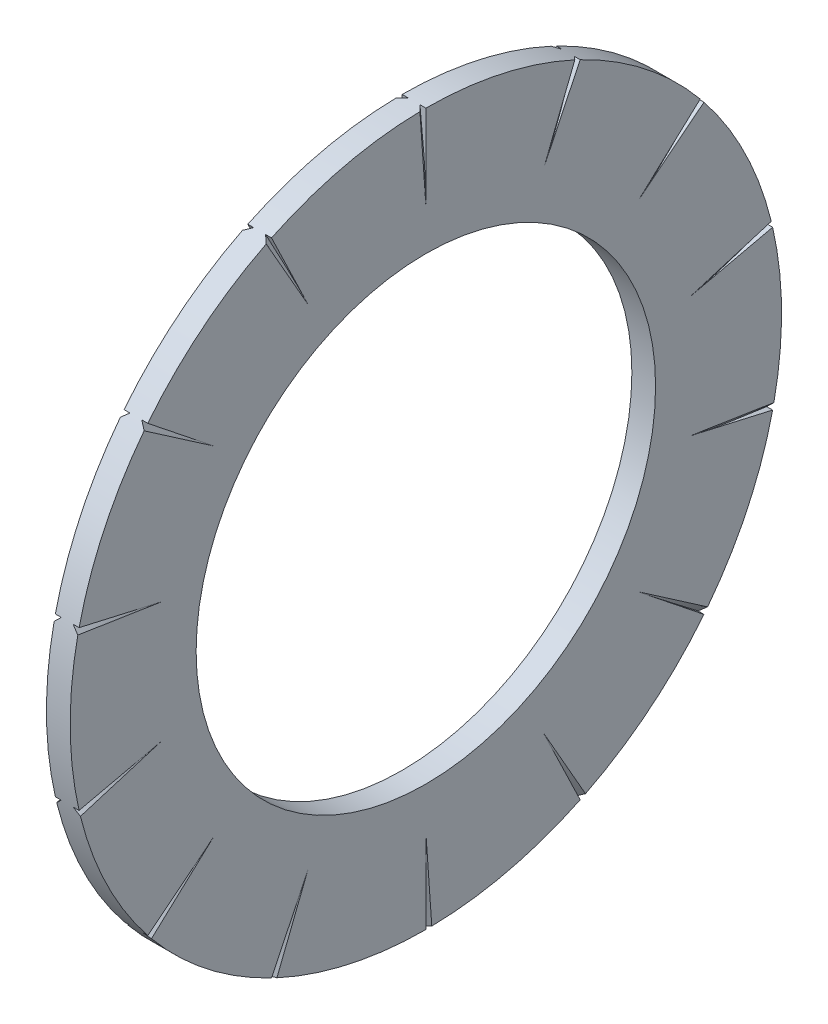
ISO-10303-21;
HEADER;
FILE_DESCRIPTION(('STEP AP214'),'2;1');
FILE_NAME('part.step','',(''),(''),'','','');
FILE_SCHEMA(('AUTOMOTIVE_DESIGN { 1 0 10303 214 1 1 1 1 }'));
ENDSEC;
DATA;
#1=APPLICATION_CONTEXT('core data for automotive mechanical design processes');
#2=APPLICATION_PROTOCOL_DEFINITION('international standard','automotive_design',2000,#1);
#3=PRODUCT_CONTEXT('',#1,'mechanical');
#4=PRODUCT('Part','Part','',(#3));
#5=PRODUCT_RELATED_PRODUCT_CATEGORY('part','',(#4));
#6=PRODUCT_DEFINITION_FORMATION('','',#4);
#7=PRODUCT_DEFINITION_CONTEXT('part definition',#1,'design');
#8=PRODUCT_DEFINITION('design','',#6,#7);
#9=PRODUCT_DEFINITION_SHAPE('','',#8);
#10=(LENGTH_UNIT() NAMED_UNIT(*) SI_UNIT(.MILLI.,.METRE.));
#11=(NAMED_UNIT(*) PLANE_ANGLE_UNIT() SI_UNIT($,.RADIAN.));
#12=(NAMED_UNIT(*) SI_UNIT($,.STERADIAN.) SOLID_ANGLE_UNIT());
#13=UNCERTAINTY_MEASURE_WITH_UNIT(LENGTH_MEASURE(1.E-05),#10,'distance_accuracy_value','');
#14=(GEOMETRIC_REPRESENTATION_CONTEXT(3) GLOBAL_UNCERTAINTY_ASSIGNED_CONTEXT((#13)) GLOBAL_UNIT_ASSIGNED_CONTEXT((#10,
#11,#12)) REPRESENTATION_CONTEXT('',''));
#15=CARTESIAN_POINT('',(0.,0.,0.));
#16=DIRECTION('',(0.,0.,1.));
#17=DIRECTION('',(1.,0.,0.));
#18=AXIS2_PLACEMENT_3D('',#15,#16,#17);
#19=CARTESIAN_POINT('',(1.6,0.,0.));
#20=DIRECTION('',(1.,0.,0.));
#21=DIRECTION('',(0.,0.,-1.));
#22=AXIS2_PLACEMENT_3D('',#19,#20,#21);
#23=PLANE('',#22);
#24=DIRECTION('',(0.,-0.868354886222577,-0.495943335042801));
#25=VECTOR('',#24,1.);
#26=CARTESIAN_POINT('',(1.6,18.9709672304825,9.35791956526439));
#27=LINE('',#26,#25);
#28=CARTESIAN_POINT('',(1.6,21.4468008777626,10.7719418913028));
#29=VERTEX_POINT('',#28);
#30=CARTESIAN_POINT('',(1.6,16.4922351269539,7.94224184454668));
#31=VERTEX_POINT('',#30);
#32=EDGE_CURVE('E2206',#29,#31,#27,.T.);
#33=ORIENTED_EDGE('',*,*,#32,.F.);
#34=CARTESIAN_POINT('',(1.6,0.,0.));
#35=DIRECTION('',(1.,0.,0.));
#36=DIRECTION('',(0.,0.,-1.));
#37=AXIS2_PLACEMENT_3D('',#34,#35,#36);
#38=CIRCLE('',#37,24.);
#39=CARTESIAN_POINT('',(1.6,14.9637552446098,18.7639555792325));
#40=VERTEX_POINT('',#39);
#41=EDGE_CURVE('E946',#29,#40,#38,.T.);
#42=ORIENTED_EDGE('',*,*,#41,.T.);
#43=DIRECTION('',(0.,0.623489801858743,0.781831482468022));
#44=VECTOR('',#43,1.);
#45=CARTESIAN_POINT('',(1.6,13.1883680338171,16.5376904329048));
#46=LINE('',#45,#44);
#47=CARTESIAN_POINT('',(1.6,11.4129808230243,14.3114252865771));
#48=VERTEX_POINT('',#47);
#49=EDGE_CURVE('E2185',#48,#40,#46,.T.);
#50=ORIENTED_EDGE('',*,*,#49,.F.);
#51=DIRECTION('',(0.,-0.567178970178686,-0.823594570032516));
#52=VECTOR('',#51,1.);
#53=CARTESIAN_POINT('',(1.6,13.0320017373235,16.6623883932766));
#54=LINE('',#53,#52);
#55=CARTESIAN_POINT('',(1.6,14.6491294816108,19.0106024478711));
#56=VERTEX_POINT('',#55);
#57=EDGE_CURVE('E2191',#56,#48,#54,.T.);
#58=ORIENTED_EDGE('',*,*,#57,.F.);
#59=CARTESIAN_POINT('',(1.6,5.34050241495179,23.3982698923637));
#60=VERTEX_POINT('',#59);
#61=EDGE_CURVE('E952',#56,#60,#38,.T.);
#62=ORIENTED_EDGE('',*,*,#61,.T.);
#63=DIRECTION('',(0.,0.222520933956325,0.974927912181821));
#64=VECTOR('',#63,1.);
#65=CARTESIAN_POINT('',(1.6,4.70687405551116,20.622162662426));
#66=LINE('',#65,#64);
#67=CARTESIAN_POINT('',(1.6,4.07324569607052,17.8460554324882));
#68=VERTEX_POINT('',#67);
#69=EDGE_CURVE('E2170',#68,#60,#66,.T.);
#70=ORIENTED_EDGE('',*,*,#69,.F.);
#71=DIRECTION('',(0.,-0.153666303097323,-0.98812279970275));
#72=VECTOR('',#71,1.);
#73=CARTESIAN_POINT('',(1.6,4.51188847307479,20.6666668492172));
#74=LINE('',#73,#72);
#75=CARTESIAN_POINT('',(1.6,4.95001833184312,23.4839800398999));
#76=VERTEX_POINT('',#75);
#77=EDGE_CURVE('E2176',#76,#68,#74,.T.);
#78=ORIENTED_EDGE('',*,*,#77,.F.);
#79=CARTESIAN_POINT('',(1.6,-5.34050241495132,23.3982698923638));
#80=VERTEX_POINT('',#79);
#81=EDGE_CURVE('E957',#76,#80,#38,.T.);
#82=ORIENTED_EDGE('',*,*,#81,.T.);
#83=DIRECTION('',(0.,-0.222520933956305,0.974927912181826));
#84=VECTOR('',#83,1.);
#85=CARTESIAN_POINT('',(1.6,-4.70687405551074,20.6221626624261));
#86=LINE('',#85,#84);
#87=CARTESIAN_POINT('',(1.6,-4.07324569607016,17.8460554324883));
#88=VERTEX_POINT('',#87);
#89=EDGE_CURVE('E2155',#88,#80,#86,.T.);
#90=ORIENTED_EDGE('',*,*,#89,.F.);
#91=DIRECTION('',(0.,0.290281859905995,-0.956941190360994));
#92=VECTOR('',#91,1.);
#93=CARTESIAN_POINT('',(1.6,-4.90185963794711,20.5776584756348));
#94=LINE('',#93,#92);
#95=CARTESIAN_POINT('',(1.6,-5.72950465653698,23.3060673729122));
#96=VERTEX_POINT('',#95);
#97=EDGE_CURVE('E2161',#96,#88,#94,.T.);
#98=ORIENTED_EDGE('',*,*,#97,.F.);
#99=CARTESIAN_POINT('',(1.6,-14.9637552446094,18.7639555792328));
#100=VERTEX_POINT('',#99);
#101=EDGE_CURVE('E962',#96,#100,#38,.T.);
#102=ORIENTED_EDGE('',*,*,#101,.T.);
#103=DIRECTION('',(0.,-0.623489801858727,0.781831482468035));
#104=VECTOR('',#103,1.);
#105=CARTESIAN_POINT('',(1.6,-13.1883680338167,16.5376904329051));
#106=LINE('',#105,#104);
#107=CARTESIAN_POINT('',(1.6,-11.412980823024,14.3114252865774));
#108=VERTEX_POINT('',#107);
#109=EDGE_CURVE('E2140',#108,#100,#106,.T.);
#110=ORIENTED_EDGE('',*,*,#109,.F.);
#111=DIRECTION('',(0.,0.676736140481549,-0.736225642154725));
#112=VECTOR('',#111,1.);
#113=CARTESIAN_POINT('',(1.6,-13.3447343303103,16.4129924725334));
#114=LINE('',#113,#112);
#115=CARTESIAN_POINT('',(1.6,-15.2742289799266,18.5121022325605));
#116=VERTEX_POINT('',#115);
#117=EDGE_CURVE('E2146',#116,#108,#114,.T.);
#118=ORIENTED_EDGE('',*,*,#117,.F.);
#119=CARTESIAN_POINT('',(1.6,-21.623252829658,10.4132097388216));
#120=VERTEX_POINT('',#119);
#121=EDGE_CURVE('E967',#116,#120,#38,.T.);
#122=ORIENTED_EDGE('',*,*,#121,.T.);
#123=DIRECTION('',(0.,-0.900968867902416,0.433883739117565));
#124=VECTOR('',#123,1.);
#125=CARTESIAN_POINT('',(1.6,-19.0577439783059,9.1777257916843));
#126=LINE('',#125,#124);
#127=CARTESIAN_POINT('',(1.6,-16.4922351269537,7.94224184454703));
#128=VERTEX_POINT('',#127);
#129=EDGE_CURVE('E2125',#128,#120,#126,.T.);
#130=ORIENTED_EDGE('',*,*,#129,.F.);
#131=DIRECTION('',(0.,0.929154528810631,-0.369691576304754));
#132=VECTOR('',#131,1.);
#133=CARTESIAN_POINT('',(1.6,-19.1445207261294,8.99753201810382));
#134=LINE('',#133,#132);
#135=CARTESIAN_POINT('',(1.6,-21.7937049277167,10.0515882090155));
#136=VERTEX_POINT('',#135);
#137=EDGE_CURVE('E2131',#136,#128,#134,.T.);
#138=ORIENTED_EDGE('',*,*,#137,.F.);
#139=CARTESIAN_POINT('',(1.6,-24.,1.6759110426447E-13));
#140=VERTEX_POINT('',#139);
#141=EDGE_CURVE('E972',#136,#140,#38,.T.);
#142=ORIENTED_EDGE('',*,*,#141,.T.);
#143=DIRECTION('',(0.,-1.,0.));
#144=VECTOR('',#143,1.);
#145=CARTESIAN_POINT('',(1.6,-21.1525,1.47652907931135E-13));
#146=LINE('',#145,#144);
#147=CARTESIAN_POINT('',(1.6,-18.305,1.27823131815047E-13));
#148=VERTEX_POINT('',#147);
#149=EDGE_CURVE('E2110',#148,#140,#146,.T.);
#150=ORIENTED_EDGE('',*,*,#149,.F.);
#151=DIRECTION('',(0.,0.997542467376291,0.0700644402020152));
#152=VECTOR('',#151,1.);
#153=CARTESIAN_POINT('',(1.6,-21.1525,-0.199999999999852));
#154=LINE('',#153,#152);
#155=CARTESIAN_POINT('',(1.6,-23.9966703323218,-0.399766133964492));
#156=VERTEX_POINT('',#155);
#157=EDGE_CURVE('E2116',#156,#148,#154,.T.);
#158=ORIENTED_EDGE('',*,*,#157,.F.);
#159=CARTESIAN_POINT('',(1.6,-21.6232528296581,-10.4132097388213));
#160=VERTEX_POINT('',#159);
#161=EDGE_CURVE('E977',#156,#160,#38,.T.);
#162=ORIENTED_EDGE('',*,*,#161,.T.);
#163=DIRECTION('',(0.,-0.900968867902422,-0.433883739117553));
#164=VECTOR('',#163,1.);
#165=CARTESIAN_POINT('',(1.6,-19.057743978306,-9.17772579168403));
#166=LINE('',#165,#164);
#167=CARTESIAN_POINT('',(1.6,-16.4922351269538,-7.9422418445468));
#168=VERTEX_POINT('',#167);
#169=EDGE_CURVE('E2095',#168,#160,#166,.T.);
#170=ORIENTED_EDGE('',*,*,#169,.F.);
#171=DIRECTION('',(0.,0.868354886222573,0.495943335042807));
#172=VECTOR('',#171,1.);
#173=CARTESIAN_POINT('',(1.6,-18.9709672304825,-9.35791956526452));
#174=LINE('',#173,#172);
#175=CARTESIAN_POINT('',(1.6,-21.4468008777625,-10.7719418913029));
#176=VERTEX_POINT('',#175);
#177=EDGE_CURVE('E2101',#176,#168,#174,.T.);
#178=ORIENTED_EDGE('',*,*,#177,.F.);
#179=CARTESIAN_POINT('',(1.6,-14.9637552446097,-18.7639555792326));
#180=VERTEX_POINT('',#179);
#181=EDGE_CURVE('E982',#176,#180,#38,.T.);
#182=ORIENTED_EDGE('',*,*,#181,.T.);
#183=DIRECTION('',(0.,-0.623489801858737,-0.781831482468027));
#184=VECTOR('',#183,1.);
#185=CARTESIAN_POINT('',(1.6,-13.1883680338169,-16.5376904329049));
#186=LINE('',#185,#184);
#187=CARTESIAN_POINT('',(1.6,-11.4129808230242,-14.3114252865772));
#188=VERTEX_POINT('',#187);
#189=EDGE_CURVE('E2080',#188,#180,#186,.T.);
#190=ORIENTED_EDGE('',*,*,#189,.F.);
#191=DIRECTION('',(0.,0.56717897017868,0.82359457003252));
#192=VECTOR('',#191,1.);
#193=CARTESIAN_POINT('',(1.6,-13.0320017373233,-16.6623883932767));
#194=LINE('',#193,#192);
#195=CARTESIAN_POINT('',(1.6,-14.6491294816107,-19.0106024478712));
#196=VERTEX_POINT('',#195);
#197=EDGE_CURVE('E2086',#196,#188,#194,.T.);
#198=ORIENTED_EDGE('',*,*,#197,.F.);
#199=CARTESIAN_POINT('',(1.6,-5.34050241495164,-23.3982698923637));
#200=VERTEX_POINT('',#199);
#201=EDGE_CURVE('E987',#196,#200,#38,.T.);
#202=ORIENTED_EDGE('',*,*,#201,.T.);
#203=DIRECTION('',(0.,-0.222520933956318,-0.974927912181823));
#204=VECTOR('',#203,1.);
#205=CARTESIAN_POINT('',(1.6,-4.70687405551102,-20.622162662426));
#206=LINE('',#205,#204);
#207=CARTESIAN_POINT('',(1.6,-4.0732456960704,-17.8460554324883));
#208=VERTEX_POINT('',#207);
#209=EDGE_CURVE('E2065',#208,#200,#206,.T.);
#210=ORIENTED_EDGE('',*,*,#209,.F.);
#211=DIRECTION('',(0.,0.153666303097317,0.988122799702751));
#212=VECTOR('',#211,1.);
#213=CARTESIAN_POINT('',(1.6,-4.51188847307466,-20.6666668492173));
#214=LINE('',#213,#212);
#215=CARTESIAN_POINT('',(1.6,-4.95001833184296,-23.4839800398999));
#216=VERTEX_POINT('',#215);
#217=EDGE_CURVE('E2071',#216,#208,#214,.T.);
#218=ORIENTED_EDGE('',*,*,#217,.F.);
#219=CARTESIAN_POINT('',(1.6,5.34050241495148,-23.3982698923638));
#220=VERTEX_POINT('',#219);
#221=EDGE_CURVE('E992',#216,#220,#38,.T.);
#222=ORIENTED_EDGE('',*,*,#221,.T.);
#223=DIRECTION('',(0.,0.222520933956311,-0.974927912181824));
#224=VECTOR('',#223,1.);
#225=CARTESIAN_POINT('',(1.6,4.70687405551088,-20.622162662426));
#226=LINE('',#225,#224);
#227=CARTESIAN_POINT('',(1.6,4.07324569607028,-17.8460554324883));
#228=VERTEX_POINT('',#227);
#229=EDGE_CURVE('E2050',#228,#220,#226,.T.);
#230=ORIENTED_EDGE('',*,*,#229,.F.);
#231=DIRECTION('',(0.,-0.290281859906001,0.956941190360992));
#232=VECTOR('',#231,1.);
#233=CARTESIAN_POINT('',(1.6,4.90185963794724,-20.5776584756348));
#234=LINE('',#233,#232);
#235=CARTESIAN_POINT('',(1.6,5.72950465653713,-23.3060673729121));
#236=VERTEX_POINT('',#235);
#237=EDGE_CURVE('E2056',#236,#228,#234,.T.);
#238=ORIENTED_EDGE('',*,*,#237,.F.);
#239=CARTESIAN_POINT('',(1.6,14.9637552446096,-18.7639555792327));
#240=VERTEX_POINT('',#239);
#241=EDGE_CURVE('E997',#236,#240,#38,.T.);
#242=ORIENTED_EDGE('',*,*,#241,.T.);
#243=DIRECTION('',(0.,0.623489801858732,-0.781831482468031));
#244=VECTOR('',#243,1.);
#245=CARTESIAN_POINT('',(1.6,13.1883680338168,-16.537690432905));
#246=LINE('',#245,#244);
#247=CARTESIAN_POINT('',(1.6,11.4129808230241,-14.3114252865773));
#248=VERTEX_POINT('',#247);
#249=EDGE_CURVE('E2040',#248,#240,#246,.T.);
#250=ORIENTED_EDGE('',*,*,#249,.F.);
#251=DIRECTION('',(0.,-0.676736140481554,0.736225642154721));
#252=VECTOR('',#251,1.);
#253=CARTESIAN_POINT('',(1.6,13.3447343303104,-16.4129924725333));
#254=LINE('',#253,#252);
#255=CARTESIAN_POINT('',(1.6,15.2742289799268,-18.5121022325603));
#256=VERTEX_POINT('',#255);
#257=EDGE_CURVE('E1013',#256,#248,#254,.T.);
#258=ORIENTED_EDGE('',*,*,#257,.F.);
#259=CARTESIAN_POINT('',(1.6,21.6232528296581,-10.4132097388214));
#260=VERTEX_POINT('',#259);
#261=EDGE_CURVE('E920',#256,#260,#38,.T.);
#262=ORIENTED_EDGE('',*,*,#261,.T.);
#263=DIRECTION('',(0.,0.900968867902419,-0.433883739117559));
#264=VECTOR('',#263,1.);
#265=CARTESIAN_POINT('',(1.6,19.0577439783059,-9.17772579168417));
#266=LINE('',#265,#264);
#267=CARTESIAN_POINT('',(1.6,16.4922351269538,-7.94224184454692));
#268=VERTEX_POINT('',#267);
#269=EDGE_CURVE('E1012',#268,#260,#266,.T.);
#270=ORIENTED_EDGE('',*,*,#269,.F.);
#271=DIRECTION('',(0.,-0.929154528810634,0.369691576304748));
#272=VECTOR('',#271,1.);
#273=CARTESIAN_POINT('',(1.6,19.1445207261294,-8.99753201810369));
#274=LINE('',#273,#272);
#275=CARTESIAN_POINT('',(1.6,21.7937049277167,-10.0515882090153));
#276=VERTEX_POINT('',#275);
#277=EDGE_CURVE('E1024',#276,#268,#274,.T.);
#278=ORIENTED_EDGE('',*,*,#277,.F.);
#279=CARTESIAN_POINT('',(1.6,24.,0.));
#280=VERTEX_POINT('',#279);
#281=EDGE_CURVE('E916',#276,#280,#38,.T.);
#282=ORIENTED_EDGE('',*,*,#281,.T.);
#283=DIRECTION('',(0.,1.,0.));
#284=VECTOR('',#283,1.);
#285=CARTESIAN_POINT('',(1.6,21.1525,0.));
#286=LINE('',#285,#284);
#287=CARTESIAN_POINT('',(1.6,18.305,0.));
#288=VERTEX_POINT('',#287);
#289=EDGE_CURVE('E1060',#288,#280,#286,.T.);
#290=ORIENTED_EDGE('',*,*,#289,.F.);
#291=DIRECTION('',(0.,-0.99754246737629,-0.0700644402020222));
#292=VECTOR('',#291,1.);
#293=CARTESIAN_POINT('',(1.6,21.1525,0.2));
#294=LINE('',#293,#292);
#295=CARTESIAN_POINT('',(1.6,23.9966703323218,0.399766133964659));
#296=VERTEX_POINT('',#295);
#297=EDGE_CURVE('E1059',#296,#288,#294,.T.);
#298=ORIENTED_EDGE('',*,*,#297,.F.);
#299=CARTESIAN_POINT('',(1.6,21.6232528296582,10.4132097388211));
#300=VERTEX_POINT('',#299);
#301=EDGE_CURVE('E922',#296,#300,#38,.T.);
#302=ORIENTED_EDGE('',*,*,#301,.T.);
#303=DIRECTION('',(0.,0.900968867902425,0.433883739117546));
#304=VECTOR('',#303,1.);
#305=CARTESIAN_POINT('',(1.6,19.057743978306,9.1777257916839));
#306=LINE('',#305,#304);
#307=EDGE_CURVE('E2200',#31,#300,#306,.T.);
#308=ORIENTED_EDGE('',*,*,#307,.F.);
#309=EDGE_LOOP('',(#33,#42,#50,#58,#62,#70,#78,#82,#90,#98,#102,#110,#118,#122,#130,#138,#142,
#150,#158,#162,#170,#178,#182,#190,#198,#202,#210,#218,#222,#230,#238,#242,#250,#258,#262,#270,
#278,#282,#290,#298,#302,#308));
#310=FACE_BOUND('',#309,.T.);
#311=CARTESIAN_POINT('',(1.6,0.,0.));
#312=DIRECTION('',(1.,0.,0.));
#313=DIRECTION('',(0.,0.,-1.));
#314=AXIS2_PLACEMENT_3D('',#311,#312,#313);
#315=CIRCLE('',#314,15.5);
#316=CARTESIAN_POINT('',(1.6,0.,-15.5));
#317=VERTEX_POINT('',#316);
#318=EDGE_CURVE('E926',#317,#317,#315,.T.);
#319=ORIENTED_EDGE('',*,*,#318,.F.);
#320=EDGE_LOOP('',(#319));
#321=FACE_BOUND('',#320,.T.);
#322=ADVANCED_FACE('F537',(#310,#321),#23,.T.);
#323=CARTESIAN_POINT('',(0.,0.,0.));
#324=DIRECTION('',(1.,0.,0.));
#325=DIRECTION('',(0.,0.,-1.));
#326=AXIS2_PLACEMENT_3D('',#323,#324,#325);
#327=PLANE('',#326);
#328=CARTESIAN_POINT('',(0.,0.,0.));
#329=DIRECTION('',(1.,0.,0.));
#330=DIRECTION('',(0.,0.,-1.));
#331=AXIS2_PLACEMENT_3D('',#328,#329,#330);
#332=CIRCLE('',#331,24.);
#333=CARTESIAN_POINT('',(0.,21.4468008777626,10.7719418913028));
#334=VERTEX_POINT('',#333);
#335=CARTESIAN_POINT('',(0.,14.9637552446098,18.7639555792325));
#336=VERTEX_POINT('',#335);
#337=EDGE_CURVE('E917',#334,#336,#332,.T.);
#338=ORIENTED_EDGE('',*,*,#337,.F.);
#339=DIRECTION('',(0.,-0.868354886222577,-0.495943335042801));
#340=VECTOR('',#339,1.);
#341=CARTESIAN_POINT('',(0.,18.9709672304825,9.35791956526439));
#342=LINE('',#341,#340);
#343=CARTESIAN_POINT('',(0.,16.4922351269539,7.94224184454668));
#344=VERTEX_POINT('',#343);
#345=EDGE_CURVE('E902',#334,#344,#342,.T.);
#346=ORIENTED_EDGE('',*,*,#345,.T.);
#347=DIRECTION('',(0.,0.900968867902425,0.433883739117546));
#348=VECTOR('',#347,1.);
#349=CARTESIAN_POINT('',(0.,19.057743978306,9.1777257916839));
#350=LINE('',#349,#348);
#351=CARTESIAN_POINT('',(0.,21.6232528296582,10.4132097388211));
#352=VERTEX_POINT('',#351);
#353=EDGE_CURVE('E898',#344,#352,#350,.T.);
#354=ORIENTED_EDGE('',*,*,#353,.T.);
#355=CARTESIAN_POINT('',(0.,23.9966703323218,0.399766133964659));
#356=VERTEX_POINT('',#355);
#357=EDGE_CURVE('E910',#356,#352,#332,.T.);
#358=ORIENTED_EDGE('',*,*,#357,.F.);
#359=DIRECTION('',(0.,-0.99754246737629,-0.0700644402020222));
#360=VECTOR('',#359,1.);
#361=CARTESIAN_POINT('',(0.,21.1525,0.2));
#362=LINE('',#361,#360);
#363=CARTESIAN_POINT('',(0.,18.305,0.));
#364=VERTEX_POINT('',#363);
#365=EDGE_CURVE('E1048',#356,#364,#362,.T.);
#366=ORIENTED_EDGE('',*,*,#365,.T.);
#367=DIRECTION('',(0.,1.,0.));
#368=VECTOR('',#367,1.);
#369=CARTESIAN_POINT('',(0.,21.1525,0.));
#370=LINE('',#369,#368);
#371=CARTESIAN_POINT('',(0.,24.,0.));
#372=VERTEX_POINT('',#371);
#373=EDGE_CURVE('E1030',#364,#372,#370,.T.);
#374=ORIENTED_EDGE('',*,*,#373,.T.);
#375=CARTESIAN_POINT('',(0.,21.7937049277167,-10.0515882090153));
#376=VERTEX_POINT('',#375);
#377=EDGE_CURVE('E919',#376,#372,#332,.T.);
#378=ORIENTED_EDGE('',*,*,#377,.F.);
#379=DIRECTION('',(0.,-0.929154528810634,0.369691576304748));
#380=VECTOR('',#379,1.);
#381=CARTESIAN_POINT('',(0.,19.1445207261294,-8.99753201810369));
#382=LINE('',#381,#380);
#383=CARTESIAN_POINT('',(0.,16.4922351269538,-7.94224184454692));
#384=VERTEX_POINT('',#383);
#385=EDGE_CURVE('E2221',#376,#384,#382,.T.);
#386=ORIENTED_EDGE('',*,*,#385,.T.);
#387=DIRECTION('',(0.,0.900968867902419,-0.433883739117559));
#388=VECTOR('',#387,1.);
#389=CARTESIAN_POINT('',(0.,19.0577439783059,-9.17772579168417));
#390=LINE('',#389,#388);
#391=CARTESIAN_POINT('',(0.,21.623252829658,-10.4132097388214));
#392=VERTEX_POINT('',#391);
#393=EDGE_CURVE('E2214',#384,#392,#390,.T.);
#394=ORIENTED_EDGE('',*,*,#393,.T.);
#395=CARTESIAN_POINT('',(0.,15.2742289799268,-18.5121022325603));
#396=VERTEX_POINT('',#395);
#397=EDGE_CURVE('E925',#396,#392,#332,.T.);
#398=ORIENTED_EDGE('',*,*,#397,.F.);
#399=DIRECTION('',(0.,-0.676736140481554,0.736225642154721));
#400=VECTOR('',#399,1.);
#401=CARTESIAN_POINT('',(0.,13.3447343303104,-16.4129924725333));
#402=LINE('',#401,#400);
#403=CARTESIAN_POINT('',(0.,11.4129808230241,-14.3114252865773));
#404=VERTEX_POINT('',#403);
#405=EDGE_CURVE('E2237',#396,#404,#402,.T.);
#406=ORIENTED_EDGE('',*,*,#405,.T.);
#407=DIRECTION('',(0.,0.623489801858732,-0.781831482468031));
#408=VECTOR('',#407,1.);
#409=CARTESIAN_POINT('',(0.,13.1883680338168,-16.537690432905));
#410=LINE('',#409,#408);
#411=CARTESIAN_POINT('',(0.,14.9637552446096,-18.7639555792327));
#412=VERTEX_POINT('',#411);
#413=EDGE_CURVE('E2230',#404,#412,#410,.T.);
#414=ORIENTED_EDGE('',*,*,#413,.T.);
#415=CARTESIAN_POINT('',(0.,5.72950465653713,-23.3060673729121));
#416=VERTEX_POINT('',#415);
#417=EDGE_CURVE('E930',#416,#412,#332,.T.);
#418=ORIENTED_EDGE('',*,*,#417,.F.);
#419=DIRECTION('',(0.,-0.290281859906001,0.956941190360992));
#420=VECTOR('',#419,1.);
#421=CARTESIAN_POINT('',(0.,4.90185963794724,-20.5776584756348));
#422=LINE('',#421,#420);
#423=CARTESIAN_POINT('',(0.,4.07324569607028,-17.8460554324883));
#424=VERTEX_POINT('',#423);
#425=EDGE_CURVE('E2253',#416,#424,#422,.T.);
#426=ORIENTED_EDGE('',*,*,#425,.T.);
#427=DIRECTION('',(0.,0.222520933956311,-0.974927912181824));
#428=VECTOR('',#427,1.);
#429=CARTESIAN_POINT('',(0.,4.70687405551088,-20.622162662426));
#430=LINE('',#429,#428);
#431=CARTESIAN_POINT('',(0.,5.34050241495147,-23.3982698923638));
#432=VERTEX_POINT('',#431);
#433=EDGE_CURVE('E2246',#424,#432,#430,.T.);
#434=ORIENTED_EDGE('',*,*,#433,.T.);
#435=CARTESIAN_POINT('',(0.,-4.95001833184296,-23.4839800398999));
#436=VERTEX_POINT('',#435);
#437=EDGE_CURVE('E2430',#436,#432,#332,.T.);
#438=ORIENTED_EDGE('',*,*,#437,.F.);
#439=DIRECTION('',(0.,0.153666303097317,0.988122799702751));
#440=VECTOR('',#439,1.);
#441=CARTESIAN_POINT('',(0.,-4.51188847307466,-20.6666668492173));
#442=LINE('',#441,#440);
#443=CARTESIAN_POINT('',(0.,-4.0732456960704,-17.8460554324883));
#444=VERTEX_POINT('',#443);
#445=EDGE_CURVE('E2269',#436,#444,#442,.T.);
#446=ORIENTED_EDGE('',*,*,#445,.T.);
#447=DIRECTION('',(0.,-0.222520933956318,-0.974927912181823));
#448=VECTOR('',#447,1.);
#449=CARTESIAN_POINT('',(0.,-4.70687405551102,-20.622162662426));
#450=LINE('',#449,#448);
#451=CARTESIAN_POINT('',(0.,-5.34050241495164,-23.3982698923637));
#452=VERTEX_POINT('',#451);
#453=EDGE_CURVE('E2262',#444,#452,#450,.T.);
#454=ORIENTED_EDGE('',*,*,#453,.T.);
#455=CARTESIAN_POINT('',(0.,-14.6491294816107,-19.0106024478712));
#456=VERTEX_POINT('',#455);
#457=EDGE_CURVE('E2427',#456,#452,#332,.T.);
#458=ORIENTED_EDGE('',*,*,#457,.F.);
#459=DIRECTION('',(0.,0.56717897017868,0.82359457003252));
#460=VECTOR('',#459,1.);
#461=CARTESIAN_POINT('',(0.,-13.0320017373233,-16.6623883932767));
#462=LINE('',#461,#460);
#463=CARTESIAN_POINT('',(0.,-11.4129808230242,-14.3114252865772));
#464=VERTEX_POINT('',#463);
#465=EDGE_CURVE('E2285',#456,#464,#462,.T.);
#466=ORIENTED_EDGE('',*,*,#465,.T.);
#467=DIRECTION('',(0.,-0.623489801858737,-0.781831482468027));
#468=VECTOR('',#467,1.);
#469=CARTESIAN_POINT('',(0.,-13.1883680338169,-16.5376904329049));
#470=LINE('',#469,#468);
#471=CARTESIAN_POINT('',(0.,-14.9637552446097,-18.7639555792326));
#472=VERTEX_POINT('',#471);
#473=EDGE_CURVE('E2278',#464,#472,#470,.T.);
#474=ORIENTED_EDGE('',*,*,#473,.T.);
#475=CARTESIAN_POINT('',(0.,-21.4468008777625,-10.7719418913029));
#476=VERTEX_POINT('',#475);
#477=EDGE_CURVE('E2423',#476,#472,#332,.T.);
#478=ORIENTED_EDGE('',*,*,#477,.F.);
#479=DIRECTION('',(0.,0.868354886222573,0.495943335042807));
#480=VECTOR('',#479,1.);
#481=CARTESIAN_POINT('',(0.,-18.9709672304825,-9.35791956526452));
#482=LINE('',#481,#480);
#483=CARTESIAN_POINT('',(0.,-16.4922351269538,-7.9422418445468));
#484=VERTEX_POINT('',#483);
#485=EDGE_CURVE('E2301',#476,#484,#482,.T.);
#486=ORIENTED_EDGE('',*,*,#485,.T.);
#487=DIRECTION('',(0.,-0.900968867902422,-0.433883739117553));
#488=VECTOR('',#487,1.);
#489=CARTESIAN_POINT('',(0.,-19.057743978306,-9.17772579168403));
#490=LINE('',#489,#488);
#491=CARTESIAN_POINT('',(0.,-21.6232528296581,-10.4132097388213));
#492=VERTEX_POINT('',#491);
#493=EDGE_CURVE('E2294',#484,#492,#490,.T.);
#494=ORIENTED_EDGE('',*,*,#493,.T.);
#495=CARTESIAN_POINT('',(0.,-23.9966703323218,-0.399766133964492));
#496=VERTEX_POINT('',#495);
#497=EDGE_CURVE('E2420',#496,#492,#332,.T.);
#498=ORIENTED_EDGE('',*,*,#497,.F.);
#499=DIRECTION('',(0.,0.997542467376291,0.0700644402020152));
#500=VECTOR('',#499,1.);
#501=CARTESIAN_POINT('',(0.,-21.1525,-0.199999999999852));
#502=LINE('',#501,#500);
#503=CARTESIAN_POINT('',(0.,-18.305,1.27823131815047E-13));
#504=VERTEX_POINT('',#503);
#505=EDGE_CURVE('E2317',#496,#504,#502,.T.);
#506=ORIENTED_EDGE('',*,*,#505,.T.);
#507=DIRECTION('',(0.,-1.,0.));
#508=VECTOR('',#507,1.);
#509=CARTESIAN_POINT('',(0.,-21.1525,1.47652907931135E-13));
#510=LINE('',#509,#508);
#511=CARTESIAN_POINT('',(0.,-24.,1.6759110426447E-13));
#512=VERTEX_POINT('',#511);
#513=EDGE_CURVE('E2310',#504,#512,#510,.T.);
#514=ORIENTED_EDGE('',*,*,#513,.T.);
#515=CARTESIAN_POINT('',(0.,-21.7937049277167,10.0515882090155));
#516=VERTEX_POINT('',#515);
#517=EDGE_CURVE('E2417',#516,#512,#332,.T.);
#518=ORIENTED_EDGE('',*,*,#517,.F.);
#519=DIRECTION('',(0.,0.929154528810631,-0.369691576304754));
#520=VECTOR('',#519,1.);
#521=CARTESIAN_POINT('',(0.,-19.1445207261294,8.99753201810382));
#522=LINE('',#521,#520);
#523=CARTESIAN_POINT('',(0.,-16.4922351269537,7.94224184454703));
#524=VERTEX_POINT('',#523);
#525=EDGE_CURVE('E2333',#516,#524,#522,.T.);
#526=ORIENTED_EDGE('',*,*,#525,.T.);
#527=DIRECTION('',(0.,-0.900968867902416,0.433883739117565));
#528=VECTOR('',#527,1.);
#529=CARTESIAN_POINT('',(0.,-19.0577439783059,9.1777257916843));
#530=LINE('',#529,#528);
#531=CARTESIAN_POINT('',(0.,-21.623252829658,10.4132097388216));
#532=VERTEX_POINT('',#531);
#533=EDGE_CURVE('E2326',#524,#532,#530,.T.);
#534=ORIENTED_EDGE('',*,*,#533,.T.);
#535=CARTESIAN_POINT('',(0.,-15.2742289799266,18.5121022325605));
#536=VERTEX_POINT('',#535);
#537=EDGE_CURVE('E2413',#536,#532,#332,.T.);
#538=ORIENTED_EDGE('',*,*,#537,.F.);
#539=DIRECTION('',(0.,0.676736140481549,-0.736225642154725));
#540=VECTOR('',#539,1.);
#541=CARTESIAN_POINT('',(0.,-13.3447343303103,16.4129924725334));
#542=LINE('',#541,#540);
#543=CARTESIAN_POINT('',(0.,-11.412980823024,14.3114252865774));
#544=VERTEX_POINT('',#543);
#545=EDGE_CURVE('E2349',#536,#544,#542,.T.);
#546=ORIENTED_EDGE('',*,*,#545,.T.);
#547=DIRECTION('',(0.,-0.623489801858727,0.781831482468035));
#548=VECTOR('',#547,1.);
#549=CARTESIAN_POINT('',(0.,-13.1883680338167,16.5376904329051));
#550=LINE('',#549,#548);
#551=CARTESIAN_POINT('',(0.,-14.9637552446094,18.7639555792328));
#552=VERTEX_POINT('',#551);
#553=EDGE_CURVE('E2342',#544,#552,#550,.T.);
#554=ORIENTED_EDGE('',*,*,#553,.T.);
#555=CARTESIAN_POINT('',(0.,-5.72950465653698,23.3060673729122));
#556=VERTEX_POINT('',#555);
#557=EDGE_CURVE('E2410',#556,#552,#332,.T.);
#558=ORIENTED_EDGE('',*,*,#557,.F.);
#559=DIRECTION('',(0.,0.290281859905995,-0.956941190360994));
#560=VECTOR('',#559,1.);
#561=CARTESIAN_POINT('',(0.,-4.90185963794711,20.5776584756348));
#562=LINE('',#561,#560);
#563=CARTESIAN_POINT('',(0.,-4.07324569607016,17.8460554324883));
#564=VERTEX_POINT('',#563);
#565=EDGE_CURVE('E2365',#556,#564,#562,.T.);
#566=ORIENTED_EDGE('',*,*,#565,.T.);
#567=DIRECTION('',(0.,-0.222520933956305,0.974927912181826));
#568=VECTOR('',#567,1.);
#569=CARTESIAN_POINT('',(0.,-4.70687405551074,20.6221626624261));
#570=LINE('',#569,#568);
#571=CARTESIAN_POINT('',(0.,-5.34050241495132,23.3982698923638));
#572=VERTEX_POINT('',#571);
#573=EDGE_CURVE('E2358',#564,#572,#570,.T.);
#574=ORIENTED_EDGE('',*,*,#573,.T.);
#575=CARTESIAN_POINT('',(0.,4.95001833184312,23.4839800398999));
#576=VERTEX_POINT('',#575);
#577=EDGE_CURVE('E2409',#576,#572,#332,.T.);
#578=ORIENTED_EDGE('',*,*,#577,.F.);
#579=DIRECTION('',(0.,-0.153666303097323,-0.98812279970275));
#580=VECTOR('',#579,1.);
#581=CARTESIAN_POINT('',(0.,4.51188847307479,20.6666668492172));
#582=LINE('',#581,#580);
#583=CARTESIAN_POINT('',(0.,4.07324569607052,17.8460554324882));
#584=VERTEX_POINT('',#583);
#585=EDGE_CURVE('E2381',#576,#584,#582,.T.);
#586=ORIENTED_EDGE('',*,*,#585,.T.);
#587=DIRECTION('',(0.,0.222520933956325,0.974927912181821));
#588=VECTOR('',#587,1.);
#589=CARTESIAN_POINT('',(0.,4.70687405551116,20.622162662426));
#590=LINE('',#589,#588);
#591=CARTESIAN_POINT('',(0.,5.34050241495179,23.3982698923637));
#592=VERTEX_POINT('',#591);
#593=EDGE_CURVE('E2374',#584,#592,#590,.T.);
#594=ORIENTED_EDGE('',*,*,#593,.T.);
#595=CARTESIAN_POINT('',(0.,14.6491294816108,19.0106024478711));
#596=VERTEX_POINT('',#595);
#597=EDGE_CURVE('E923',#596,#592,#332,.T.);
#598=ORIENTED_EDGE('',*,*,#597,.F.);
#599=DIRECTION('',(0.,-0.567178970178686,-0.823594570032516));
#600=VECTOR('',#599,1.);
#601=CARTESIAN_POINT('',(0.,13.0320017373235,16.6623883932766));
#602=LINE('',#601,#600);
#603=CARTESIAN_POINT('',(0.,11.4129808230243,14.3114252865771));
#604=VERTEX_POINT('',#603);
#605=EDGE_CURVE('E2395',#596,#604,#602,.T.);
#606=ORIENTED_EDGE('',*,*,#605,.T.);
#607=DIRECTION('',(0.,0.623489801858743,0.781831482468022));
#608=VECTOR('',#607,1.);
#609=CARTESIAN_POINT('',(0.,13.1883680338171,16.5376904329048));
#610=LINE('',#609,#608);
#611=EDGE_CURVE('E2389',#604,#336,#610,.T.);
#612=ORIENTED_EDGE('',*,*,#611,.T.);
#613=EDGE_LOOP('',(#338,#346,#354,#358,#366,#374,#378,#386,#394,#398,#406,#414,#418,#426,#434,
#438,#446,#454,#458,#466,#474,#478,#486,#494,#498,#506,#514,#518,#526,#534,#538,#546,#554,#558,
#566,#574,#578,#586,#594,#598,#606,#612));
#614=FACE_BOUND('',#613,.T.);
#615=CARTESIAN_POINT('',(0.,0.,0.));
#616=DIRECTION('',(1.,0.,0.));
#617=DIRECTION('',(0.,0.,-1.));
#618=AXIS2_PLACEMENT_3D('',#615,#616,#617);
#619=CIRCLE('',#618,15.5);
#620=CARTESIAN_POINT('',(0.,0.,-15.5));
#621=VERTEX_POINT('',#620);
#622=EDGE_CURVE('E932',#621,#621,#619,.T.);
#623=ORIENTED_EDGE('',*,*,#622,.T.);
#624=EDGE_LOOP('',(#623));
#625=FACE_BOUND('',#624,.T.);
#626=ADVANCED_FACE('F907',(#614,#625),#327,.F.);
#627=CARTESIAN_POINT('',(1.6,0.,0.));
#628=DIRECTION('',(-1.,0.,0.));
#629=DIRECTION('',(0.,0.,1.));
#630=AXIS2_PLACEMENT_3D('',#627,#628,#629);
#631=CYLINDRICAL_SURFACE('',#630,24.);
#632=ORIENTED_EDGE('',*,*,#41,.F.);
#633=CARTESIAN_POINT('',(1.6,21.4468008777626,10.7719418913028));
#634=CARTESIAN_POINT('',(1.56665431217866,21.4617563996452,10.7421656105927));
#635=CARTESIAN_POINT('',(1.53330805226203,21.4766496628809,10.712358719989));
#636=CARTESIAN_POINT('',(1.46661648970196,21.5063123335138,10.6526823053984));
#637=CARTESIAN_POINT('',(1.43327118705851,21.5210817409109,10.6228127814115));
#638=CARTESIAN_POINT('',(1.33327603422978,21.5651892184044,10.5331405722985));
#639=CARTESIAN_POINT('',(1.26663076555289,21.5943427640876,10.4732419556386));
#640=CARTESIAN_POINT('',(1.2,21.6232528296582,10.4132097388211));
#641=B_SPLINE_CURVE_WITH_KNOTS('',3,(#633,#634,#635,#636,#637,#638,#639,#640),.UNSPECIFIED.,.F.,
.F.,(4,2,2,4),(0.,0.141421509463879,0.282843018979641,0.565532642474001),.UNSPECIFIED.);
#642=CARTESIAN_POINT('',(1.2,21.6232528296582,10.4132097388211));
#643=VERTEX_POINT('',#642);
#644=EDGE_CURVE('E1840',#29,#643,#641,.T.);
#645=ORIENTED_EDGE('',*,*,#644,.T.);
#646=DIRECTION('',(-1.,0.,0.));
#647=VECTOR('',#646,1.);
#648=CARTESIAN_POINT('',(1.2,21.6232528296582,10.4132097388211));
#649=LINE('',#648,#647);
#650=EDGE_CURVE('E2186',#300,#643,#649,.T.);
#651=ORIENTED_EDGE('',*,*,#650,.F.);
#652=ORIENTED_EDGE('',*,*,#301,.F.);
#653=CARTESIAN_POINT('',(1.6,23.9966703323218,0.39976613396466));
#654=CARTESIAN_POINT('',(1.56665431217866,23.9972253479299,0.366449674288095));
#655=CARTESIAN_POINT('',(1.53330805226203,23.9977109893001,0.33313264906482));
#656=CARTESIAN_POINT('',(1.46661648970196,23.9985435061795,0.266495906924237));
#657=CARTESIAN_POINT('',(1.43327118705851,23.9988903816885,0.233176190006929));
#658=CARTESIAN_POINT('',(1.33327603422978,23.999722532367,0.133246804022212));
#659=CARTESIAN_POINT('',(1.26663076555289,23.9999999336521,0.0666307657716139));
#660=CARTESIAN_POINT('',(1.2,24.,0.));
#661=B_SPLINE_CURVE_WITH_KNOTS('',3,(#653,#654,#655,#656,#657,#658,#659,#660),.UNSPECIFIED.,.F.,
.F.,(4,2,2,4),(0.,0.141421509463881,0.282843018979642,0.565532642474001),.UNSPECIFIED.);
#662=CARTESIAN_POINT('',(1.2,24.,0.));
#663=VERTEX_POINT('',#662);
#664=EDGE_CURVE('E945',#296,#663,#661,.T.);
#665=ORIENTED_EDGE('',*,*,#664,.T.);
#666=DIRECTION('',(-1.,0.,0.));
#667=VECTOR('',#666,1.);
#668=CARTESIAN_POINT('',(1.2,24.,0.));
#669=LINE('',#668,#667);
#670=EDGE_CURVE('E937',#280,#663,#669,.T.);
#671=ORIENTED_EDGE('',*,*,#670,.F.);
#672=ORIENTED_EDGE('',*,*,#281,.F.);
#673=CARTESIAN_POINT('',(1.6,21.7937049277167,-10.0515882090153));
#674=CARTESIAN_POINT('',(1.56665431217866,21.7797495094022,-10.0818461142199));
#675=CARTESIAN_POINT('',(1.53330805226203,21.7657313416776,-10.1120744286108));
#676=CARTESIAN_POINT('',(1.46661648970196,21.7375688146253,-10.1724732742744));
#677=CARTESIAN_POINT('',(1.43327118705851,21.7234244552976,-10.2026438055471));
#678=CARTESIAN_POINT('',(1.33327603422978,21.6808164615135,-10.2930381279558));
#679=CARTESIAN_POINT('',(1.26663076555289,21.6521627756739,-10.3531774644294));
#680=CARTESIAN_POINT('',(1.2,21.623252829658,-10.4132097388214));
#681=B_SPLINE_CURVE_WITH_KNOTS('',3,(#673,#674,#675,#676,#677,#678,#679,#680),.UNSPECIFIED.,.F.,
.F.,(4,2,2,4),(0.,0.141421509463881,0.28284301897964,0.565532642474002),.UNSPECIFIED.);
#682=CARTESIAN_POINT('',(1.2,21.623252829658,-10.4132097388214));
#683=VERTEX_POINT('',#682);
#684=EDGE_CURVE('E1027',#276,#683,#681,.T.);
#685=ORIENTED_EDGE('',*,*,#684,.T.);
#686=DIRECTION('',(-1.,0.,0.));
#687=VECTOR('',#686,1.);
#688=CARTESIAN_POINT('',(1.2,21.623252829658,-10.4132097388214));
#689=LINE('',#688,#687);
#690=EDGE_CURVE('E1021',#260,#683,#689,.T.);
#691=ORIENTED_EDGE('',*,*,#690,.F.);
#692=ORIENTED_EDGE('',*,*,#261,.F.);
#693=CARTESIAN_POINT('',(1.6,15.2742289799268,-18.5121022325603));
#694=CARTESIAN_POINT('',(1.56665431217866,15.2485271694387,-18.5333086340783));
#695=CARTESIAN_POINT('',(1.53330805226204,15.2227816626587,-18.5544611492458));
#696=CARTESIAN_POINT('',(1.46661648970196,15.1712020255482,-18.5966593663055));
#697=CARTESIAN_POINT('',(1.43327118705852,15.1453678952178,-18.6177050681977));
#698=CARTESIAN_POINT('',(1.33327603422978,15.0677587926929,-18.6806606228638));
#699=CARTESIAN_POINT('',(1.26663076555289,15.0158492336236,-18.7224119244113));
#700=CARTESIAN_POINT('',(1.2,14.9637552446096,-18.7639555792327));
#701=B_SPLINE_CURVE_WITH_KNOTS('',3,(#693,#694,#695,#696,#697,#698,#699,#700),.UNSPECIFIED.,.F.,
.F.,(4,2,2,4),(0.,0.141421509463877,0.282843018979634,0.565532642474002),.UNSPECIFIED.);
#702=CARTESIAN_POINT('',(1.2,14.9637552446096,-18.7639555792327));
#703=VERTEX_POINT('',#702);
#704=EDGE_CURVE('E1986',#256,#703,#701,.T.);
#705=ORIENTED_EDGE('',*,*,#704,.T.);
#706=DIRECTION('',(-1.,0.,0.));
#707=VECTOR('',#706,1.);
#708=CARTESIAN_POINT('',(1.2,14.9637552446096,-18.7639555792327));
#709=LINE('',#708,#707);
#710=EDGE_CURVE('E1042',#240,#703,#709,.T.);
#711=ORIENTED_EDGE('',*,*,#710,.F.);
#712=ORIENTED_EDGE('',*,*,#241,.F.);
#713=CARTESIAN_POINT('',(1.6,5.72950465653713,-23.3060673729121));
#714=CARTESIAN_POINT('',(1.56665431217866,5.69714701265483,-23.3140220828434));
#715=CARTESIAN_POINT('',(1.53330805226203,5.66477338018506,-23.3219092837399));
#716=CARTESIAN_POINT('',(1.46661648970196,5.59999261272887,-23.3375489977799));
#717=CARTESIAN_POINT('',(1.43327118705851,5.56758547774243,-23.3453015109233));
#718=CARTESIAN_POINT('',(1.33327603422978,5.47034670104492,-23.3683491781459));
#719=CARTESIAN_POINT('',(1.26663076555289,5.40546259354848,-23.3834430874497));
#720=CARTESIAN_POINT('',(1.2,5.34050241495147,-23.3982698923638));
#721=B_SPLINE_CURVE_WITH_KNOTS('',3,(#713,#714,#715,#716,#717,#718,#719,#720),.UNSPECIFIED.,.F.,
.F.,(4,2,2,4),(0.,0.141421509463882,0.282843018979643,0.565532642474),.UNSPECIFIED.);
#722=CARTESIAN_POINT('',(1.2,5.34050241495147,-23.3982698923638));
#723=VERTEX_POINT('',#722);
#724=EDGE_CURVE('E1979',#236,#723,#721,.T.);
#725=ORIENTED_EDGE('',*,*,#724,.T.);
#726=DIRECTION('',(-1.,0.,0.));
#727=VECTOR('',#726,1.);
#728=CARTESIAN_POINT('',(1.2,5.34050241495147,-23.3982698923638));
#729=LINE('',#728,#727);
#730=EDGE_CURVE('E2041',#220,#723,#729,.T.);
#731=ORIENTED_EDGE('',*,*,#730,.F.);
#732=ORIENTED_EDGE('',*,*,#221,.F.);
#733=CARTESIAN_POINT('',(1.6,-4.95001833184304,-23.4839800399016));
#734=CARTESIAN_POINT('',(1.56665431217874,-4.98262298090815,-23.4771075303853));
#735=CARTESIAN_POINT('',(1.53330805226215,-5.01521274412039,-23.4701672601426));
#736=CARTESIAN_POINT('',(1.46661648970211,-5.08036401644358,-23.4561508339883));
#737=CARTESIAN_POINT('',(1.43327118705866,-5.11292552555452,-23.4490746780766));
#738=CARTESIAN_POINT('',(1.33327603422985,-5.21053464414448,-23.4276495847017));
#739=CARTESIAN_POINT('',(1.26663076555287,-5.27554220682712,-23.4130965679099));
#740=CARTESIAN_POINT('',(1.2,-5.34050241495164,-23.3982698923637));
#741=B_SPLINE_CURVE_WITH_KNOTS('',3,(#733,#734,#735,#736,#737,#738,#739,#740),.UNSPECIFIED.,.F.,
.F.,(4,2,2,4),(0.,0.141421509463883,0.282843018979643,0.565532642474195),.UNSPECIFIED.);
#742=CARTESIAN_POINT('',(1.2,-5.34050241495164,-23.3982698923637));
#743=VERTEX_POINT('',#742);
#744=EDGE_CURVE('E1972',#216,#743,#741,.T.);
#745=ORIENTED_EDGE('',*,*,#744,.T.);
#746=DIRECTION('',(-1.,0.,0.));
#747=VECTOR('',#746,1.);
#748=CARTESIAN_POINT('',(1.2,-5.34050241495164,-23.3982698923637));
#749=LINE('',#748,#747);
#750=EDGE_CURVE('E2051',#200,#743,#749,.T.);
#751=ORIENTED_EDGE('',*,*,#750,.F.);
#752=ORIENTED_EDGE('',*,*,#201,.F.);
#753=CARTESIAN_POINT('',(1.6,-14.6491294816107,-19.0106024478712));
#754=CARTESIAN_POINT('',(1.56665431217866,-14.6755233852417,-18.9902639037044));
#755=CARTESIAN_POINT('',(1.53330805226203,-14.7018744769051,-18.9698707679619));
#756=CARTESIAN_POINT('',(1.46661648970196,-14.7544922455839,-18.9289743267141));
#757=CARTESIAN_POINT('',(1.43327118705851,-14.7807589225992,-18.9084710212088));
#758=CARTESIAN_POINT('',(1.33327603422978,-14.8594057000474,-18.84681666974));
#759=CARTESIAN_POINT('',(1.26663076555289,-14.9116611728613,-18.8054991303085));
#760=CARTESIAN_POINT('',(1.2,-14.9637552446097,-18.7639555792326));
#761=B_SPLINE_CURVE_WITH_KNOTS('',3,(#753,#754,#755,#756,#757,#758,#759,#760),.UNSPECIFIED.,.F.,
.F.,(4,2,2,4),(0.,0.141421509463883,0.282843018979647,0.565532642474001),.UNSPECIFIED.);
#762=CARTESIAN_POINT('',(1.2,-14.9637552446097,-18.7639555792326));
#763=VERTEX_POINT('',#762);
#764=EDGE_CURVE('E1942',#196,#763,#761,.T.);
#765=ORIENTED_EDGE('',*,*,#764,.T.);
#766=DIRECTION('',(-1.,0.,0.));
#767=VECTOR('',#766,1.);
#768=CARTESIAN_POINT('',(1.2,-14.9637552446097,-18.7639555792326));
#769=LINE('',#768,#767);
#770=EDGE_CURVE('E2066',#180,#763,#769,.T.);
#771=ORIENTED_EDGE('',*,*,#770,.F.);
#772=ORIENTED_EDGE('',*,*,#181,.F.);
#773=CARTESIAN_POINT('',(1.6,-21.4468008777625,-10.7719418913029));
#774=CARTESIAN_POINT('',(1.56665431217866,-21.4617563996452,-10.7421656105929));
#775=CARTESIAN_POINT('',(1.53330805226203,-21.4766496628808,-10.7123587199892));
#776=CARTESIAN_POINT('',(1.46661648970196,-21.5063123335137,-10.6526823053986));
#777=CARTESIAN_POINT('',(1.43327118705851,-21.5210817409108,-10.6228127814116));
#778=CARTESIAN_POINT('',(1.33327603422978,-21.5651892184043,-10.5331405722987));
#779=CARTESIAN_POINT('',(1.26663076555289,-21.5943427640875,-10.4732419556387));
#780=CARTESIAN_POINT('',(1.2,-21.6232528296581,-10.4132097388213));
#781=B_SPLINE_CURVE_WITH_KNOTS('',3,(#773,#774,#775,#776,#777,#778,#779,#780),.UNSPECIFIED.,.F.,
.F.,(4,2,2,4),(0.,0.141421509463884,0.282843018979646,0.565532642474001),.UNSPECIFIED.);
#782=CARTESIAN_POINT('',(1.2,-21.6232528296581,-10.4132097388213));
#783=VERTEX_POINT('',#782);
#784=EDGE_CURVE('E1935',#176,#783,#781,.T.);
#785=ORIENTED_EDGE('',*,*,#784,.T.);
#786=DIRECTION('',(-1.,0.,0.));
#787=VECTOR('',#786,1.);
#788=CARTESIAN_POINT('',(1.2,-21.6232528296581,-10.4132097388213));
#789=LINE('',#788,#787);
#790=EDGE_CURVE('E2081',#160,#783,#789,.T.);
#791=ORIENTED_EDGE('',*,*,#790,.F.);
#792=ORIENTED_EDGE('',*,*,#161,.F.);
#793=CARTESIAN_POINT('',(1.6,-23.9966703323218,-0.399766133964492));
#794=CARTESIAN_POINT('',(1.56665431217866,-23.9972253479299,-0.366449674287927));
#795=CARTESIAN_POINT('',(1.53330805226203,-23.9977109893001,-0.333132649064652));
#796=CARTESIAN_POINT('',(1.46661648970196,-23.9985435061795,-0.266495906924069));
#797=CARTESIAN_POINT('',(1.43327118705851,-23.9988903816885,-0.233176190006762));
#798=CARTESIAN_POINT('',(1.33327603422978,-23.999722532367,-0.133246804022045));
#799=CARTESIAN_POINT('',(1.26663076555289,-23.9999999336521,-0.0666307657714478));
#800=CARTESIAN_POINT('',(1.2,-24.,1.6759110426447E-13));
#801=B_SPLINE_CURVE_WITH_KNOTS('',3,(#793,#794,#795,#796,#797,#798,#799,#800),.UNSPECIFIED.,.F.,
.F.,(4,2,2,4),(0.,0.141421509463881,0.282843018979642,0.565532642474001),.UNSPECIFIED.);
#802=CARTESIAN_POINT('',(1.2,-24.,1.6759110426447E-13));
#803=VERTEX_POINT('',#802);
#804=EDGE_CURVE('E1928',#156,#803,#801,.T.);
#805=ORIENTED_EDGE('',*,*,#804,.T.);
#806=DIRECTION('',(-1.,0.,0.));
#807=VECTOR('',#806,1.);
#808=CARTESIAN_POINT('',(1.2,-24.,1.6759110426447E-13));
#809=LINE('',#808,#807);
#810=EDGE_CURVE('E2096',#140,#803,#809,.T.);
#811=ORIENTED_EDGE('',*,*,#810,.F.);
#812=ORIENTED_EDGE('',*,*,#141,.F.);
#813=CARTESIAN_POINT('',(1.6,-21.7937049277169,10.0515882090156));
#814=CARTESIAN_POINT('',(1.56665431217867,-21.7797495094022,10.0818461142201));
#815=CARTESIAN_POINT('',(1.53330805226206,-21.7657313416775,10.1120744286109));
#816=CARTESIAN_POINT('',(1.46661648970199,-21.7375688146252,10.1724732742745));
#817=CARTESIAN_POINT('',(1.43327118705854,-21.7234244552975,10.2026438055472));
#818=CARTESIAN_POINT('',(1.33327603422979,-21.6808164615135,10.293038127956));
#819=CARTESIAN_POINT('',(1.26663076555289,-21.652162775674,10.3531774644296));
#820=CARTESIAN_POINT('',(1.2,-21.623252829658,10.4132097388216));
#821=B_SPLINE_CURVE_WITH_KNOTS('',3,(#813,#814,#815,#816,#817,#818,#819,#820),.UNSPECIFIED.,.F.,
.F.,(4,2,2,4),(0.,0.141421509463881,0.282843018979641,0.565532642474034),.UNSPECIFIED.);
#822=CARTESIAN_POINT('',(1.2,-21.623252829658,10.4132097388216));
#823=VERTEX_POINT('',#822);
#824=EDGE_CURVE('E1898',#136,#823,#821,.T.);
#825=ORIENTED_EDGE('',*,*,#824,.T.);
#826=DIRECTION('',(-1.,0.,0.));
#827=VECTOR('',#826,1.);
#828=CARTESIAN_POINT('',(1.2,-21.623252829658,10.4132097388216));
#829=LINE('',#828,#827);
#830=EDGE_CURVE('E2111',#120,#823,#829,.T.);
#831=ORIENTED_EDGE('',*,*,#830,.F.);
#832=ORIENTED_EDGE('',*,*,#121,.F.);
#833=CARTESIAN_POINT('',(1.6,-15.2742289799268,18.5121022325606));
#834=CARTESIAN_POINT('',(1.56665431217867,-15.2485271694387,18.5333086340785));
#835=CARTESIAN_POINT('',(1.53330805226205,-15.2227816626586,18.5544611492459));
#836=CARTESIAN_POINT('',(1.46661648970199,-15.1712020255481,18.5966593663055));
#837=CARTESIAN_POINT('',(1.43327118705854,-15.1453678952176,18.6177050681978));
#838=CARTESIAN_POINT('',(1.33327603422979,-15.0677587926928,18.6806606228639));
#839=CARTESIAN_POINT('',(1.26663076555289,-15.0158492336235,18.7224119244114));
#840=CARTESIAN_POINT('',(1.2,-14.9637552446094,18.7639555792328));
#841=B_SPLINE_CURVE_WITH_KNOTS('',3,(#833,#834,#835,#836,#837,#838,#839,#840),.UNSPECIFIED.,.F.,
.F.,(4,2,2,4),(0.,0.141421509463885,0.282843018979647,0.565532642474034),.UNSPECIFIED.);
#842=CARTESIAN_POINT('',(1.2,-14.9637552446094,18.7639555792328));
#843=VERTEX_POINT('',#842);
#844=EDGE_CURVE('E1891',#116,#843,#841,.T.);
#845=ORIENTED_EDGE('',*,*,#844,.T.);
#846=DIRECTION('',(-1.,0.,0.));
#847=VECTOR('',#846,1.);
#848=CARTESIAN_POINT('',(1.2,-14.9637552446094,18.7639555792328));
#849=LINE('',#848,#847);
#850=EDGE_CURVE('E2126',#100,#843,#849,.T.);
#851=ORIENTED_EDGE('',*,*,#850,.F.);
#852=ORIENTED_EDGE('',*,*,#101,.F.);
#853=CARTESIAN_POINT('',(1.6,-5.72950465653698,23.3060673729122));
#854=CARTESIAN_POINT('',(1.56665431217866,-5.69714701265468,23.3140220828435));
#855=CARTESIAN_POINT('',(1.53330805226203,-5.66477338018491,23.32190928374));
#856=CARTESIAN_POINT('',(1.46661648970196,-5.59999261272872,23.3375489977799));
#857=CARTESIAN_POINT('',(1.43327118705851,-5.56758547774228,23.3453015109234));
#858=CARTESIAN_POINT('',(1.33327603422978,-5.47034670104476,23.368349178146));
#859=CARTESIAN_POINT('',(1.26663076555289,-5.40546259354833,23.3834430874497));
#860=CARTESIAN_POINT('',(1.2,-5.34050241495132,23.3982698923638));
#861=B_SPLINE_CURVE_WITH_KNOTS('',3,(#853,#854,#855,#856,#857,#858,#859,#860),.UNSPECIFIED.,.F.,
.F.,(4,2,2,4),(0.,0.141421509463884,0.282843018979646,0.565532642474),.UNSPECIFIED.);
#862=CARTESIAN_POINT('',(1.2,-5.34050241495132,23.3982698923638));
#863=VERTEX_POINT('',#862);
#864=EDGE_CURVE('E1884',#96,#863,#861,.T.);
#865=ORIENTED_EDGE('',*,*,#864,.T.);
#866=DIRECTION('',(-1.,0.,0.));
#867=VECTOR('',#866,1.);
#868=CARTESIAN_POINT('',(1.2,-5.34050241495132,23.3982698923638));
#869=LINE('',#868,#867);
#870=EDGE_CURVE('E2141',#80,#863,#869,.T.);
#871=ORIENTED_EDGE('',*,*,#870,.F.);
#872=ORIENTED_EDGE('',*,*,#81,.F.);
#873=CARTESIAN_POINT('',(1.6,4.95001833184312,23.4839800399));
#874=CARTESIAN_POINT('',(1.56665431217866,4.98262298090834,23.4771075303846));
#875=CARTESIAN_POINT('',(1.53330805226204,5.01521274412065,23.4701672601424));
#876=CARTESIAN_POINT('',(1.46661648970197,5.08036401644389,23.4561508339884));
#877=CARTESIAN_POINT('',(1.43327118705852,5.11292552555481,23.4490746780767));
#878=CARTESIAN_POINT('',(1.33327603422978,5.21053464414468,23.4276495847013));
#879=CARTESIAN_POINT('',(1.26663076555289,5.2755422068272,23.4130965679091));
#880=CARTESIAN_POINT('',(1.2,5.34050241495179,23.3982698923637));
#881=B_SPLINE_CURVE_WITH_KNOTS('',3,(#873,#874,#875,#876,#877,#878,#879,#880),.UNSPECIFIED.,.F.,
.F.,(4,2,2,4),(0.,0.141421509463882,0.282843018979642,0.565532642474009),.UNSPECIFIED.);
#882=CARTESIAN_POINT('',(1.2,5.34050241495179,23.3982698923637));
#883=VERTEX_POINT('',#882);
#884=EDGE_CURVE('E1854',#76,#883,#881,.T.);
#885=ORIENTED_EDGE('',*,*,#884,.T.);
#886=DIRECTION('',(-1.,0.,0.));
#887=VECTOR('',#886,1.);
#888=CARTESIAN_POINT('',(1.2,5.34050241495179,23.3982698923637));
#889=LINE('',#888,#887);
#890=EDGE_CURVE('E2156',#60,#883,#889,.T.);
#891=ORIENTED_EDGE('',*,*,#890,.F.);
#892=ORIENTED_EDGE('',*,*,#61,.F.);
#893=CARTESIAN_POINT('',(1.6,14.6491294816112,19.0106024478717));
#894=CARTESIAN_POINT('',(1.56665431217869,14.675523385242,18.9902639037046));
#895=CARTESIAN_POINT('',(1.53330805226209,14.7018744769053,18.9698707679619));
#896=CARTESIAN_POINT('',(1.46661648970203,14.7544922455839,18.9289743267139));
#897=CARTESIAN_POINT('',(1.43327118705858,14.7807589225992,18.9084710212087));
#898=CARTESIAN_POINT('',(1.33327603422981,14.8594057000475,18.8468166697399));
#899=CARTESIAN_POINT('',(1.26663076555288,14.9116611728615,18.8054991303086));
#900=CARTESIAN_POINT('',(1.2,14.9637552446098,18.7639555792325));
#901=B_SPLINE_CURVE_WITH_KNOTS('',3,(#893,#894,#895,#896,#897,#898,#899,#900),.UNSPECIFIED.,.F.,
.F.,(4,2,2,4),(0.,0.141421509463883,0.282843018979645,0.565532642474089),.UNSPECIFIED.);
#902=CARTESIAN_POINT('',(1.2,14.9637552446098,18.7639555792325));
#903=VERTEX_POINT('',#902);
#904=EDGE_CURVE('E1847',#56,#903,#901,.T.);
#905=ORIENTED_EDGE('',*,*,#904,.T.);
#906=DIRECTION('',(-1.,0.,0.));
#907=VECTOR('',#906,1.);
#908=CARTESIAN_POINT('',(1.2,14.9637552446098,18.7639555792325));
#909=LINE('',#908,#907);
#910=EDGE_CURVE('E2171',#40,#903,#909,.T.);
#911=ORIENTED_EDGE('',*,*,#910,.F.);
#912=EDGE_LOOP('',(#632,#645,#651,#652,#665,#671,#672,#685,#691,#692,#705,#711,#712,#725,#731,
#732,#745,#751,#752,#765,#771,#772,#785,#791,#792,#805,#811,#812,#825,#831,#832,#845,#851,#852,
#865,#871,#872,#885,#891,#892,#905,#911));
#913=FACE_BOUND('',#912,.T.);
#914=DIRECTION('',(1.,0.,0.));
#915=VECTOR('',#914,1.);
#916=CARTESIAN_POINT('',(0.4,21.6232528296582,10.4132097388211));
#917=LINE('',#916,#915);
#918=CARTESIAN_POINT('',(0.4,21.6232528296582,10.4132097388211));
#919=VERTEX_POINT('',#918);
#920=EDGE_CURVE('E895',#352,#919,#917,.T.);
#921=ORIENTED_EDGE('',*,*,#920,.T.);
#922=CARTESIAN_POINT('',(0.4,21.6232528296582,10.4132097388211));
#923=CARTESIAN_POINT('',(0.333352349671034,21.5943354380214,10.4732571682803));
#924=CARTESIAN_POINT('',(0.266690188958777,21.5651744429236,10.5331709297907));
#925=CARTESIAN_POINT('',(0.166686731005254,21.5210631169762,10.6228504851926));
#926=CARTESIAN_POINT('',(0.133350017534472,21.5062974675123,10.6527122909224));
#927=CARTESIAN_POINT('',(0.0666753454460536,21.4766422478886,10.7123735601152));
#928=CARTESIAN_POINT('',(0.0333373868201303,21.4617526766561,10.7421730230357));
#929=CARTESIAN_POINT('',(0.,21.4468008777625,10.7719418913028));
#930=B_SPLINE_CURVE_WITH_KNOTS('',3,(#922,#923,#924,#925,#926,#927,#928,#929),.UNSPECIFIED.,.F.,
.F.,(4,2,2,4),(0.,0.28276125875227,0.424146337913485,0.565532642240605),.UNSPECIFIED.);
#931=EDGE_CURVE('E12',#919,#334,#930,.T.);
#932=ORIENTED_EDGE('',*,*,#931,.T.);
#933=ORIENTED_EDGE('',*,*,#337,.T.);
#934=DIRECTION('',(1.,0.,0.));
#935=VECTOR('',#934,1.);
#936=CARTESIAN_POINT('',(0.4,14.9637552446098,18.7639555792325));
#937=LINE('',#936,#935);
#938=CARTESIAN_POINT('',(0.4,14.9637552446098,18.7639555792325));
#939=VERTEX_POINT('',#938);
#940=EDGE_CURVE('E2375',#336,#939,#937,.T.);
#941=ORIENTED_EDGE('',*,*,#940,.T.);
#942=CARTESIAN_POINT('',(0.4,14.9637552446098,18.7639555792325));
#943=CARTESIAN_POINT('',(0.333352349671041,14.9116479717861,18.805509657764));
#944=CARTESIAN_POINT('',(0.266690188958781,14.8593792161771,18.8468376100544));
#945=CARTESIAN_POINT('',(0.166686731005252,14.7807257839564,18.9084969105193));
#946=CARTESIAN_POINT('',(0.13335001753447,14.7544658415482,18.9289948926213));
#947=CARTESIAN_POINT('',(0.0666753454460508,14.7018613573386,18.9698809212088));
#948=CARTESIAN_POINT('',(0.0333373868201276,14.675516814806,18.9902689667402));
#949=CARTESIAN_POINT('',(0.,14.6491294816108,19.0106024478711));
#950=B_SPLINE_CURVE_WITH_KNOTS('',3,(#942,#943,#944,#945,#946,#947,#948,#949),.UNSPECIFIED.,.F.,
.F.,(4,2,2,4),(0.,0.282761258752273,0.424146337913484,0.565532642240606),.UNSPECIFIED.);
#951=EDGE_CURVE('E551',#939,#596,#950,.T.);
#952=ORIENTED_EDGE('',*,*,#951,.T.);
#953=ORIENTED_EDGE('',*,*,#597,.T.);
#954=DIRECTION('',(1.,0.,0.));
#955=VECTOR('',#954,1.);
#956=CARTESIAN_POINT('',(0.4,5.34050241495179,23.3982698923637));
#957=LINE('',#956,#955);
#958=CARTESIAN_POINT('',(0.4,5.34050241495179,23.3982698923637));
#959=VERTEX_POINT('',#958);
#960=EDGE_CURVE('E2359',#592,#959,#957,.T.);
#961=ORIENTED_EDGE('',*,*,#960,.T.);
#962=CARTESIAN_POINT('',(0.4,5.34050241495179,23.3982698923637));
#963=CARTESIAN_POINT('',(0.333352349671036,5.27552574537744,23.4131003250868));
#964=CARTESIAN_POINT('',(0.266690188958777,5.21050169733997,23.427656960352));
#965=CARTESIAN_POINT('',(0.166686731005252,5.11288443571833,23.4490836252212));
#966=CARTESIAN_POINT('',(0.13335001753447,5.08033130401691,23.4561579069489));
#967=CARTESIAN_POINT('',(0.0666753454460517,5.01519651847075,23.4701707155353));
#968=CARTESIAN_POINT('',(0.0333373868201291,4.9826148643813,23.477109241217));
#969=CARTESIAN_POINT('',(0.,4.95001833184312,23.4839800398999));
#970=B_SPLINE_CURVE_WITH_KNOTS('',3,(#962,#963,#964,#965,#966,#967,#968,#969),.UNSPECIFIED.,.F.,
.F.,(4,2,2,4),(0.,0.282761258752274,0.424146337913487,0.565532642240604),.UNSPECIFIED.);
#971=EDGE_CURVE('E1671',#959,#576,#970,.T.);
#972=ORIENTED_EDGE('',*,*,#971,.T.);
#973=ORIENTED_EDGE('',*,*,#577,.T.);
#974=DIRECTION('',(1.,0.,0.));
#975=VECTOR('',#974,1.);
#976=CARTESIAN_POINT('',(0.4,-5.34050241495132,23.3982698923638));
#977=LINE('',#976,#975);
#978=CARTESIAN_POINT('',(0.4,-5.34050241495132,23.3982698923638));
#979=VERTEX_POINT('',#978);
#980=EDGE_CURVE('E2343',#572,#979,#977,.T.);
#981=ORIENTED_EDGE('',*,*,#980,.T.);
#982=CARTESIAN_POINT('',(0.4,-5.34050241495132,23.3982698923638));
#983=CARTESIAN_POINT('',(0.333352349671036,-5.40547905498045,23.3834393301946));
#984=CARTESIAN_POINT('',(0.266690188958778,-5.47037958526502,23.3683415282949));
#985=CARTESIAN_POINT('',(0.166686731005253,-5.56762638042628,23.3452917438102));
#986=CARTESIAN_POINT('',(0.133350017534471,-5.60002515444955,23.337541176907));
#987=CARTESIAN_POINT('',(0.0666753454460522,-5.66478949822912,23.3219053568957));
#988=CARTESIAN_POINT('',(0.0333373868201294,-5.69715506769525,23.3140201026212));
#989=CARTESIAN_POINT('',(0.,-5.72950465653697,23.3060673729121));
#990=B_SPLINE_CURVE_WITH_KNOTS('',3,(#982,#983,#984,#985,#986,#987,#988,#989),.UNSPECIFIED.,.F.,
.F.,(4,2,2,4),(0.,0.282761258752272,0.424146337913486,0.565532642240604),.UNSPECIFIED.);
#991=EDGE_CURVE('E1678',#979,#556,#990,.T.);
#992=ORIENTED_EDGE('',*,*,#991,.T.);
#993=ORIENTED_EDGE('',*,*,#557,.T.);
#994=DIRECTION('',(1.,0.,0.));
#995=VECTOR('',#994,1.);
#996=CARTESIAN_POINT('',(0.4,-14.9637552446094,18.7639555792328));
#997=LINE('',#996,#995);
#998=CARTESIAN_POINT('',(0.4,-14.9637552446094,18.7639555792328));
#999=VERTEX_POINT('',#998);
#1000=EDGE_CURVE('E2327',#552,#999,#997,.T.);
#1001=ORIENTED_EDGE('',*,*,#1000,.T.);
#1002=CARTESIAN_POINT('',(0.4,-14.9637552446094,18.7639555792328));
#1003=CARTESIAN_POINT('',(0.333352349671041,-15.0158624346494,18.7224013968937));
#1004=CARTESIAN_POINT('',(0.266690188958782,-15.0677851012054,18.6806394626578));
#1005=CARTESIAN_POINT('',(0.166686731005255,-15.1454005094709,18.6176785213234));
#1006=CARTESIAN_POINT('',(0.133350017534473,-15.1712279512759,18.596638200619));
#1007=CARTESIAN_POINT('',(0.0666753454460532,-15.2227944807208,18.5544506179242));
#1008=CARTESIAN_POINT('',(0.0333373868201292,-15.2485335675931,18.5333033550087));
#1009=CARTESIAN_POINT('',(0.,-15.2742289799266,18.5121022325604));
#1010=B_SPLINE_CURVE_WITH_KNOTS('',3,(#1002,#1003,#1004,#1005,#1006,#1007,#1008,#1009),
.UNSPECIFIED.,.F.,.F.,(4,2,2,4),(0.,0.282761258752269,0.424146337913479,0.565532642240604),.UNSPECIFIED.);
#1011=EDGE_CURVE('E1708',#999,#536,#1010,.T.);
#1012=ORIENTED_EDGE('',*,*,#1011,.T.);
#1013=ORIENTED_EDGE('',*,*,#537,.T.);
#1014=DIRECTION('',(1.,0.,0.));
#1015=VECTOR('',#1014,1.);
#1016=CARTESIAN_POINT('',(0.4,-21.623252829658,10.4132097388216));
#1017=LINE('',#1016,#1015);
#1018=CARTESIAN_POINT('',(0.4,-21.623252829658,10.4132097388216));
#1019=VERTEX_POINT('',#1018);
#1020=EDGE_CURVE('E2311',#532,#1019,#1017,.T.);
#1021=ORIENTED_EDGE('',*,*,#1020,.T.);
#1022=CARTESIAN_POINT('',(0.4,-21.623252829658,10.4132097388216));
#1023=CARTESIAN_POINT('',(0.33335234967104,-21.6521701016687,10.3531622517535));
#1024=CARTESIAN_POINT('',(0.26669018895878,-21.680830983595,10.2930076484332));
#1025=CARTESIAN_POINT('',(0.166686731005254,-21.7234423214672,10.2026057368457));
#1026=CARTESIAN_POINT('',(0.133350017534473,-21.7375829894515,10.1724429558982));
#1027=CARTESIAN_POINT('',(0.066675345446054,-21.7657383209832,10.1120593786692));
#1028=CARTESIAN_POINT('',(0.0333373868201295,-21.7797529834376,10.0818385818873));
#1029=CARTESIAN_POINT('',(0.,-21.7937049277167,10.0515882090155));
#1030=B_SPLINE_CURVE_WITH_KNOTS('',3,(#1022,#1023,#1024,#1025,#1026,#1027,#1028,#1029),
.UNSPECIFIED.,.F.,.F.,(4,2,2,4),(0.,0.282761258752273,0.42414633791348,0.565532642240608),.UNSPECIFIED.);
#1031=EDGE_CURVE('E1715',#1019,#516,#1030,.T.);
#1032=ORIENTED_EDGE('',*,*,#1031,.T.);
#1033=ORIENTED_EDGE('',*,*,#517,.T.);
#1034=DIRECTION('',(1.,0.,0.));
#1035=VECTOR('',#1034,1.);
#1036=CARTESIAN_POINT('',(0.4,-24.,1.6759110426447E-13));
#1037=LINE('',#1036,#1035);
#1038=CARTESIAN_POINT('',(0.4,-24.,1.6759110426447E-13));
#1039=VERTEX_POINT('',#1038);
#1040=EDGE_CURVE('E2295',#512,#1039,#1037,.T.);
#1041=ORIENTED_EDGE('',*,*,#1040,.T.);
#1042=CARTESIAN_POINT('',(0.4,-24.,1.6759110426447E-13));
#1043=CARTESIAN_POINT('',(0.333352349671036,-23.9999999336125,-0.0666476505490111));
#1044=CARTESIAN_POINT('',(0.266690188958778,-23.999722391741,-0.133280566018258));
#1045=CARTESIAN_POINT('',(0.166686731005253,-23.9988899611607,-0.233218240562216));
#1046=CARTESIAN_POINT('',(0.133350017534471,-23.9985431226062,-0.266529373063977));
#1047=CARTESIAN_POINT('',(0.0666753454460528,-23.9977107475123,-0.333149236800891));
#1048=CARTESIAN_POINT('',(0.0333373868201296,-23.997225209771,-0.366457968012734));
#1049=CARTESIAN_POINT('',(0.,-23.9966703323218,-0.399766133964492));
#1050=B_SPLINE_CURVE_WITH_KNOTS('',3,(#1042,#1043,#1044,#1045,#1046,#1047,#1048,#1049),
.UNSPECIFIED.,.F.,.F.,(4,2,2,4),(0.,0.282761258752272,0.424146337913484,0.565532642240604),.UNSPECIFIED.);
#1051=EDGE_CURVE('E1722',#1039,#496,#1050,.T.);
#1052=ORIENTED_EDGE('',*,*,#1051,.T.);
#1053=ORIENTED_EDGE('',*,*,#497,.T.);
#1054=DIRECTION('',(1.,0.,0.));
#1055=VECTOR('',#1054,1.);
#1056=CARTESIAN_POINT('',(0.4,-21.6232528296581,-10.4132097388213));
#1057=LINE('',#1056,#1055);
#1058=CARTESIAN_POINT('',(0.4,-21.6232528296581,-10.4132097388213));
#1059=VERTEX_POINT('',#1058);
#1060=EDGE_CURVE('E2279',#492,#1059,#1057,.T.);
#1061=ORIENTED_EDGE('',*,*,#1060,.T.);
#1062=CARTESIAN_POINT('',(0.4,-21.6232528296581,-10.4132097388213));
#1063=CARTESIAN_POINT('',(0.33335234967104,-21.5943354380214,-10.4732571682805));
#1064=CARTESIAN_POINT('',(0.266690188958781,-21.5651744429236,-10.5331709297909));
#1065=CARTESIAN_POINT('',(0.166686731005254,-21.5210631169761,-10.6228504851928));
#1066=CARTESIAN_POINT('',(0.133350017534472,-21.5062974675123,-10.6527122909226));
#1067=CARTESIAN_POINT('',(0.0666753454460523,-21.4766422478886,-10.7123735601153));
#1068=CARTESIAN_POINT('',(0.0333373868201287,-21.461752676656,-10.7421730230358));
#1069=CARTESIAN_POINT('',(0.,-21.4468008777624,-10.7719418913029));
#1070=B_SPLINE_CURVE_WITH_KNOTS('',3,(#1062,#1063,#1064,#1065,#1066,#1067,#1068,#1069),
.UNSPECIFIED.,.F.,.F.,(4,2,2,4),(0.,0.282761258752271,0.424146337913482,0.565532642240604),.UNSPECIFIED.);
#1071=EDGE_CURVE('E1752',#1059,#476,#1070,.T.);
#1072=ORIENTED_EDGE('',*,*,#1071,.T.);
#1073=ORIENTED_EDGE('',*,*,#477,.T.);
#1074=DIRECTION('',(1.,0.,0.));
#1075=VECTOR('',#1074,1.);
#1076=CARTESIAN_POINT('',(0.4,-14.9637552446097,-18.7639555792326));
#1077=LINE('',#1076,#1075);
#1078=CARTESIAN_POINT('',(0.4,-14.9637552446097,-18.7639555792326));
#1079=VERTEX_POINT('',#1078);
#1080=EDGE_CURVE('E2263',#472,#1079,#1077,.T.);
#1081=ORIENTED_EDGE('',*,*,#1080,.T.);
#1082=CARTESIAN_POINT('',(0.4,-14.9637552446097,-18.7639555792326));
#1083=CARTESIAN_POINT('',(0.333352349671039,-14.9116479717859,-18.8055096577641));
#1084=CARTESIAN_POINT('',(0.26669018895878,-14.859379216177,-18.8468376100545));
#1085=CARTESIAN_POINT('',(0.166686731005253,-14.7807257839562,-18.9084969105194));
#1086=CARTESIAN_POINT('',(0.13335001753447,-14.7544658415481,-18.9289948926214));
#1087=CARTESIAN_POINT('',(0.0666753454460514,-14.7018613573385,-18.9698809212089));
#1088=CARTESIAN_POINT('',(0.0333373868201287,-14.6755168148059,-18.9902689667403));
#1089=CARTESIAN_POINT('',(0.,-14.6491294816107,-19.0106024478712));
#1090=B_SPLINE_CURVE_WITH_KNOTS('',3,(#1082,#1083,#1084,#1085,#1086,#1087,#1088,#1089),
.UNSPECIFIED.,.F.,.F.,(4,2,2,4),(0.,0.282761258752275,0.424146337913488,0.565532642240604),.UNSPECIFIED.);
#1091=EDGE_CURVE('E1759',#1079,#456,#1090,.T.);
#1092=ORIENTED_EDGE('',*,*,#1091,.T.);
#1093=ORIENTED_EDGE('',*,*,#457,.T.);
#1094=DIRECTION('',(1.,0.,0.));
#1095=VECTOR('',#1094,1.);
#1096=CARTESIAN_POINT('',(0.4,-5.34050241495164,-23.3982698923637));
#1097=LINE('',#1096,#1095);
#1098=CARTESIAN_POINT('',(0.4,-5.34050241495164,-23.3982698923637));
#1099=VERTEX_POINT('',#1098);
#1100=EDGE_CURVE('E2247',#452,#1099,#1097,.T.);
#1101=ORIENTED_EDGE('',*,*,#1100,.T.);
#1102=CARTESIAN_POINT('',(0.4,-5.34050241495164,-23.3982698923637));
#1103=CARTESIAN_POINT('',(0.333352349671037,-5.27552574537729,-23.4131003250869));
#1104=CARTESIAN_POINT('',(0.266690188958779,-5.21050169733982,-23.4276569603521));
#1105=CARTESIAN_POINT('',(0.166686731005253,-5.11288443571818,-23.4490836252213));
#1106=CARTESIAN_POINT('',(0.133350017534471,-5.08033130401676,-23.4561579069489));
#1107=CARTESIAN_POINT('',(0.0666753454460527,-5.01519651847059,-23.4701707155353));
#1108=CARTESIAN_POINT('',(0.0333373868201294,-4.98261486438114,-23.477109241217));
#1109=CARTESIAN_POINT('',(0.,-4.95001833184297,-23.4839800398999));
#1110=B_SPLINE_CURVE_WITH_KNOTS('',3,(#1102,#1103,#1104,#1105,#1106,#1107,#1108,#1109),
.UNSPECIFIED.,.F.,.F.,(4,2,2,4),(0.,0.282761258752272,0.424146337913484,0.565532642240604),.UNSPECIFIED.);
#1111=EDGE_CURVE('E1766',#1099,#436,#1110,.T.);
#1112=ORIENTED_EDGE('',*,*,#1111,.T.);
#1113=ORIENTED_EDGE('',*,*,#437,.T.);
#1114=DIRECTION('',(1.,0.,0.));
#1115=VECTOR('',#1114,1.);
#1116=CARTESIAN_POINT('',(0.4,5.34050241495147,-23.3982698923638));
#1117=LINE('',#1116,#1115);
#1118=CARTESIAN_POINT('',(0.4,5.34050241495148,-23.3982698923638));
#1119=VERTEX_POINT('',#1118);
#1120=EDGE_CURVE('E2231',#432,#1119,#1117,.T.);
#1121=ORIENTED_EDGE('',*,*,#1120,.T.);
#1122=CARTESIAN_POINT('',(0.4,5.34050241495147,-23.3982698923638));
#1123=CARTESIAN_POINT('',(0.333352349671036,5.40547905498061,-23.3834393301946));
#1124=CARTESIAN_POINT('',(0.266690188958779,5.47037958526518,-23.3683415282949));
#1125=CARTESIAN_POINT('',(0.166686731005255,5.56762638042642,-23.3452917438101));
#1126=CARTESIAN_POINT('',(0.133350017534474,5.6000251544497,-23.3375411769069));
#1127=CARTESIAN_POINT('',(0.0666753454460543,5.66478949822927,-23.3219053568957));
#1128=CARTESIAN_POINT('',(0.0333373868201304,5.6971550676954,-23.3140201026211));
#1129=CARTESIAN_POINT('',(0.,5.72950465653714,-23.3060673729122));
#1130=B_SPLINE_CURVE_WITH_KNOTS('',3,(#1122,#1123,#1124,#1125,#1126,#1127,#1128,#1129),
.UNSPECIFIED.,.F.,.F.,(4,2,2,4),(0.,0.282761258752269,0.424146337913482,0.565532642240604),.UNSPECIFIED.);
#1131=EDGE_CURVE('E1796',#1119,#416,#1130,.T.);
#1132=ORIENTED_EDGE('',*,*,#1131,.T.);
#1133=ORIENTED_EDGE('',*,*,#417,.T.);
#1134=DIRECTION('',(1.,0.,0.));
#1135=VECTOR('',#1134,1.);
#1136=CARTESIAN_POINT('',(0.4,14.9637552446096,-18.7639555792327));
#1137=LINE('',#1136,#1135);
#1138=CARTESIAN_POINT('',(0.4,14.9637552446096,-18.7639555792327));
#1139=VERTEX_POINT('',#1138);
#1140=EDGE_CURVE('E2215',#412,#1139,#1137,.T.);
#1141=ORIENTED_EDGE('',*,*,#1140,.T.);
#1142=CARTESIAN_POINT('',(0.4,14.9637552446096,-18.7639555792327));
#1143=CARTESIAN_POINT('',(0.333352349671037,15.0158624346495,-18.7224013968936));
#1144=CARTESIAN_POINT('',(0.266690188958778,15.0677851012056,-18.6806394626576));
#1145=CARTESIAN_POINT('',(0.166686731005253,15.1454005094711,-18.6176785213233));
#1146=CARTESIAN_POINT('',(0.133350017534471,15.171227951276,-18.5966382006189));
#1147=CARTESIAN_POINT('',(0.0666753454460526,15.2227944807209,-18.5544506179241));
#1148=CARTESIAN_POINT('',(0.0333373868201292,15.2485335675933,-18.5333033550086));
#1149=CARTESIAN_POINT('',(0.,15.2742289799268,-18.5121022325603));
#1150=B_SPLINE_CURVE_WITH_KNOTS('',3,(#1142,#1143,#1144,#1145,#1146,#1147,#1148,#1149),
.UNSPECIFIED.,.F.,.F.,(4,2,2,4),(0.,0.282761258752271,0.424146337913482,0.565532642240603),.UNSPECIFIED.);
#1151=EDGE_CURVE('E1803',#1139,#396,#1150,.T.);
#1152=ORIENTED_EDGE('',*,*,#1151,.T.);
#1153=ORIENTED_EDGE('',*,*,#397,.T.);
#1154=DIRECTION('',(1.,0.,0.));
#1155=VECTOR('',#1154,1.);
#1156=CARTESIAN_POINT('',(0.4,21.623252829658,-10.4132097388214));
#1157=LINE('',#1156,#1155);
#1158=CARTESIAN_POINT('',(0.4,21.6232528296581,-10.4132097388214));
#1159=VERTEX_POINT('',#1158);
#1160=EDGE_CURVE('E2201',#392,#1159,#1157,.T.);
#1161=ORIENTED_EDGE('',*,*,#1160,.T.);
#1162=CARTESIAN_POINT('',(0.4,21.623252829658,-10.4132097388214));
#1163=CARTESIAN_POINT('',(0.333352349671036,21.6521701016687,-10.3531622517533));
#1164=CARTESIAN_POINT('',(0.266690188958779,21.680830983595,-10.293007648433));
#1165=CARTESIAN_POINT('',(0.166686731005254,21.7234423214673,-10.2026057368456));
#1166=CARTESIAN_POINT('',(0.133350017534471,21.7375829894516,-10.172442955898));
#1167=CARTESIAN_POINT('',(0.0666753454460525,21.7657383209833,-10.1120593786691));
#1168=CARTESIAN_POINT('',(0.0333373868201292,21.7797529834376,-10.0818385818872));
#1169=CARTESIAN_POINT('',(0.,21.7937049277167,-10.0515882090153));
#1170=B_SPLINE_CURVE_WITH_KNOTS('',3,(#1162,#1163,#1164,#1165,#1166,#1167,#1168,#1169),
.UNSPECIFIED.,.F.,.F.,(4,2,2,4),(0.,0.282761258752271,0.424146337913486,0.565532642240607),.UNSPECIFIED.);
#1171=EDGE_CURVE('E1810',#1159,#376,#1170,.T.);
#1172=ORIENTED_EDGE('',*,*,#1171,.T.);
#1173=ORIENTED_EDGE('',*,*,#377,.T.);
#1174=DIRECTION('',(1.,0.,0.));
#1175=VECTOR('',#1174,1.);
#1176=CARTESIAN_POINT('',(0.4,24.,0.));
#1177=LINE('',#1176,#1175);
#1178=CARTESIAN_POINT('',(0.4,24.,0.));
#1179=VERTEX_POINT('',#1178);
#1180=EDGE_CURVE('E1043',#372,#1179,#1177,.T.);
#1181=ORIENTED_EDGE('',*,*,#1180,.T.);
#1182=CARTESIAN_POINT('',(0.4,24.,0.));
#1183=CARTESIAN_POINT('',(0.333352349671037,23.9999999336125,0.0666476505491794));
#1184=CARTESIAN_POINT('',(0.266690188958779,23.999722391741,0.133280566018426));
#1185=CARTESIAN_POINT('',(0.166686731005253,23.9988899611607,0.233218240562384));
#1186=CARTESIAN_POINT('',(0.133350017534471,23.9985431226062,0.266529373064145));
#1187=CARTESIAN_POINT('',(0.0666753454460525,23.9977107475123,0.333149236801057));
#1188=CARTESIAN_POINT('',(0.0333373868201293,23.997225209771,0.3664579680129));
#1189=CARTESIAN_POINT('',(0.,23.9966703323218,0.399766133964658));
#1190=B_SPLINE_CURVE_WITH_KNOTS('',3,(#1182,#1183,#1184,#1185,#1186,#1187,#1188,#1189),
.UNSPECIFIED.,.F.,.F.,(4,2,2,4),(0.,0.282761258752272,0.424146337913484,0.565532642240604),.UNSPECIFIED.);
#1191=EDGE_CURVE('E915',#1179,#356,#1190,.T.);
#1192=ORIENTED_EDGE('',*,*,#1191,.T.);
#1193=ORIENTED_EDGE('',*,*,#357,.T.);
#1194=EDGE_LOOP('',(#921,#932,#933,#941,#952,#953,#961,#972,#973,#981,#992,#993,#1001,#1012,
#1013,#1021,#1032,#1033,#1041,#1052,#1053,#1061,#1072,#1073,#1081,#1092,#1093,#1101,#1112,#1113,
#1121,#1132,#1133,#1141,#1152,#1153,#1161,#1172,#1173,#1181,#1192,#1193));
#1195=FACE_BOUND('',#1194,.T.);
#1196=ADVANCED_FACE('F539',(#913,#1195),#631,.T.);
#1197=CARTESIAN_POINT('',(1.6,0.,0.));
#1198=DIRECTION('',(-1.,0.,0.));
#1199=DIRECTION('',(0.,0.,1.));
#1200=AXIS2_PLACEMENT_3D('',#1197,#1198,#1199);
#1201=CYLINDRICAL_SURFACE('',#1200,15.5);
#1202=ORIENTED_EDGE('',*,*,#318,.T.);
#1203=EDGE_LOOP('',(#1202));
#1204=FACE_BOUND('',#1203,.T.);
#1205=ORIENTED_EDGE('',*,*,#622,.F.);
#1206=EDGE_LOOP('',(#1205));
#1207=FACE_BOUND('',#1206,.T.);
#1208=ADVANCED_FACE('F1071',(#1204,#1207),#1201,.F.);
#1209=CARTESIAN_POINT('',(1.6,24.,0.4));
#1210=CARTESIAN_POINT('',(1.6,23.3672222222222,0.355555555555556));
#1211=CARTESIAN_POINT('',(1.6,22.1016666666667,0.266666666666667));
#1212=CARTESIAN_POINT('',(1.6,20.2033333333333,0.133333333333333));
#1213=CARTESIAN_POINT('',(1.6,18.9377777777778,0.0444444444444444));
#1214=CARTESIAN_POINT('',(1.6,18.305,0.));
#1215=CARTESIAN_POINT('',(1.2,24.,0.));
#1216=CARTESIAN_POINT('',(1.26666666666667,23.3672222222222,0.));
#1217=CARTESIAN_POINT('',(1.4,22.1016666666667,0.));
#1218=CARTESIAN_POINT('',(1.55555555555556,20.2033333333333,0.));
#1219=CARTESIAN_POINT('',(1.6,18.9377777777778,0.));
#1220=CARTESIAN_POINT('',(1.6,18.305,0.));
#1221=B_SPLINE_SURFACE_WITH_KNOTS('',1,3,((#1209,#1210,#1211,#1212,#1213,#1214),(#1215,#1216,
#1217,#1218,#1219,#1220)),.UNSPECIFIED.,.F.,.F.,.F.,(2,2),(4,1,1,4),(0.,1.),(0.,
0.333333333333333,0.666666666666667,1.),.UNSPECIFIED.);
#1222=CARTESIAN_POINT('',(1.2,24.,0.));
#1223=CARTESIAN_POINT('',(1.26666666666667,23.3672222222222,0.));
#1224=CARTESIAN_POINT('',(1.4,22.1016666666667,0.));
#1225=CARTESIAN_POINT('',(1.55555555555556,20.2033333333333,0.));
#1226=CARTESIAN_POINT('',(1.6,18.9377777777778,0.));
#1227=CARTESIAN_POINT('',(1.6,18.305,0.));
#1228=B_SPLINE_CURVE_WITH_KNOTS('',3,(#1222,#1223,#1224,#1225,#1226,#1227),.UNSPECIFIED.,.F.,
.F.,(4,1,1,4),(0.,0.333333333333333,0.666666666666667,1.),.UNSPECIFIED.);
#1229=EDGE_CURVE('E940',#663,#288,#1228,.T.);
#1230=ORIENTED_EDGE('',*,*,#297,.T.);
#1231=ORIENTED_EDGE('',*,*,#1229,.F.);
#1232=ORIENTED_EDGE('',*,*,#664,.F.);
#1233=EDGE_LOOP('',(#1230,#1231,#1232));
#1234=FACE_BOUND('',#1233,.T.);
#1235=ADVANCED_FACE('F1069',(#1234),#1221,.F.);
#1236=CARTESIAN_POINT('',(1.2,24.,0.));
#1237=DIRECTION('',(0.,0.,-1.));
#1238=DIRECTION('',(1.,0.,0.));
#1239=AXIS2_PLACEMENT_3D('',#1236,#1237,#1238);
#1240=PLANE('',#1239);
#1241=ORIENTED_EDGE('',*,*,#670,.T.);
#1242=ORIENTED_EDGE('',*,*,#1229,.T.);
#1243=ORIENTED_EDGE('',*,*,#289,.T.);
#1244=EDGE_LOOP('',(#1241,#1242,#1243));
#1245=FACE_BOUND('',#1244,.T.);
#1246=ADVANCED_FACE('F1066',(#1245),#1240,.F.);
#1247=CARTESIAN_POINT('',(0.,24.,0.4));
#1248=CARTESIAN_POINT('',(0.,23.3672222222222,0.355555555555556));
#1249=CARTESIAN_POINT('',(0.,22.1016666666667,0.266666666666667));
#1250=CARTESIAN_POINT('',(0.,20.2033333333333,0.133333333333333));
#1251=CARTESIAN_POINT('',(0.,18.9377777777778,0.0444444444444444));
#1252=CARTESIAN_POINT('',(0.,18.305,0.));
#1253=CARTESIAN_POINT('',(0.4,24.,0.));
#1254=CARTESIAN_POINT('',(0.333333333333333,23.3672222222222,0.));
#1255=CARTESIAN_POINT('',(0.2,22.1016666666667,0.));
#1256=CARTESIAN_POINT('',(0.0444444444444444,20.2033333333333,0.));
#1257=CARTESIAN_POINT('',(0.,18.9377777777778,0.));
#1258=CARTESIAN_POINT('',(0.,18.305,0.));
#1259=B_SPLINE_SURFACE_WITH_KNOTS('',1,3,((#1247,#1248,#1249,#1250,#1251,#1252),(#1253,#1254,
#1255,#1256,#1257,#1258)),.UNSPECIFIED.,.F.,.F.,.F.,(2,2),(4,1,1,4),(0.,1.),(0.,
0.333333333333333,0.666666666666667,1.),.UNSPECIFIED.);
#1260=CARTESIAN_POINT('',(0.4,24.,0.));
#1261=CARTESIAN_POINT('',(0.333333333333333,23.3672222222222,0.));
#1262=CARTESIAN_POINT('',(0.2,22.1016666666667,0.));
#1263=CARTESIAN_POINT('',(0.0444444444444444,20.2033333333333,0.));
#1264=CARTESIAN_POINT('',(0.,18.9377777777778,0.));
#1265=CARTESIAN_POINT('',(0.,18.305,0.));
#1266=B_SPLINE_CURVE_WITH_KNOTS('',3,(#1260,#1261,#1262,#1263,#1264,#1265),.UNSPECIFIED.,.F.,
.F.,(4,1,1,4),(0.,0.333333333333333,0.666666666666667,1.),.UNSPECIFIED.);
#1267=EDGE_CURVE('E1028',#1179,#364,#1266,.T.);
#1268=ORIENTED_EDGE('',*,*,#1267,.T.);
#1269=ORIENTED_EDGE('',*,*,#365,.F.);
#1270=ORIENTED_EDGE('',*,*,#1191,.F.);
#1271=EDGE_LOOP('',(#1268,#1269,#1270));
#1272=FACE_BOUND('',#1271,.T.);
#1273=ADVANCED_FACE('F1077',(#1272),#1259,.T.);
#1274=CARTESIAN_POINT('',(0.4,24.,0.));
#1275=DIRECTION('',(0.,0.,-1.));
#1276=DIRECTION('',(-1.,0.,0.));
#1277=AXIS2_PLACEMENT_3D('',#1274,#1275,#1276);
#1278=PLANE('',#1277);
#1279=ORIENTED_EDGE('',*,*,#1180,.F.);
#1280=ORIENTED_EDGE('',*,*,#373,.F.);
#1281=ORIENTED_EDGE('',*,*,#1267,.F.);
#1282=EDGE_LOOP('',(#1279,#1280,#1281));
#1283=FACE_BOUND('',#1282,.T.);
#1284=ADVANCED_FACE('F1118',(#1283),#1278,.F.);
#1285=CARTESIAN_POINT('',(1.6,21.7968063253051,-10.0528221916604));
#1286=CARTESIAN_POINT('',(1.6,21.2074095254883,-9.81831326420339));
#1287=CARTESIAN_POINT('',(1.6,20.0286159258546,-9.34929540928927));
#1288=CARTESIAN_POINT('',(1.6,18.2604255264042,-8.64576862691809));
#1289=CARTESIAN_POINT('',(1.6,17.0816319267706,-8.17675077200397));
#1290=CARTESIAN_POINT('',(1.6,16.4922351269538,-7.94224184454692));
#1291=CARTESIAN_POINT('',(1.2,21.623252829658,-10.4132097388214));
#1292=CARTESIAN_POINT('',(1.26666666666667,21.0531397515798,-10.1386577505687));
#1293=CARTESIAN_POINT('',(1.4,19.9129135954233,-9.58955377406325));
#1294=CARTESIAN_POINT('',(1.55555555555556,18.2025743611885,-8.76589780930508));
#1295=CARTESIAN_POINT('',(1.6,17.062348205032,-8.21679383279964));
#1296=CARTESIAN_POINT('',(1.6,16.4922351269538,-7.94224184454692));
#1297=B_SPLINE_SURFACE_WITH_KNOTS('',1,3,((#1285,#1286,#1287,#1288,#1289,#1290),(#1291,#1292,
#1293,#1294,#1295,#1296)),.UNSPECIFIED.,.F.,.F.,.F.,(2,2),(4,1,1,4),(0.,1.),(0.,
0.333333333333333,0.666666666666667,1.),.UNSPECIFIED.);
#1298=CARTESIAN_POINT('',(1.2,21.623252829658,-10.4132097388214));
#1299=CARTESIAN_POINT('',(1.26666666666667,21.0531397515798,-10.1386577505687));
#1300=CARTESIAN_POINT('',(1.4,19.9129135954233,-9.58955377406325));
#1301=CARTESIAN_POINT('',(1.55555555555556,18.2025743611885,-8.76589780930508));
#1302=CARTESIAN_POINT('',(1.6,17.062348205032,-8.21679383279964));
#1303=CARTESIAN_POINT('',(1.6,16.4922351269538,-7.94224184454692));
#1304=B_SPLINE_CURVE_WITH_KNOTS('',3,(#1298,#1299,#1300,#1301,#1302,#1303),.UNSPECIFIED.,.F.,
.F.,(4,1,1,4),(0.,0.333333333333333,0.666666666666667,1.),.UNSPECIFIED.);
#1305=EDGE_CURVE('E1023',#683,#268,#1304,.T.);
#1306=ORIENTED_EDGE('',*,*,#277,.T.);
#1307=ORIENTED_EDGE('',*,*,#1305,.F.);
#1308=ORIENTED_EDGE('',*,*,#684,.F.);
#1309=EDGE_LOOP('',(#1306,#1307,#1308));
#1310=FACE_BOUND('',#1309,.T.);
#1311=ADVANCED_FACE('F1127',(#1310),#1297,.F.);
#1312=CARTESIAN_POINT('',(1.2,21.623252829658,-10.4132097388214));
#1313=DIRECTION('',(0.,-0.433883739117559,-0.900968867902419));
#1314=DIRECTION('',(1.,0.,0.));
#1315=AXIS2_PLACEMENT_3D('',#1312,#1313,#1314);
#1316=PLANE('',#1315);
#1317=ORIENTED_EDGE('',*,*,#690,.T.);
#1318=ORIENTED_EDGE('',*,*,#1305,.T.);
#1319=ORIENTED_EDGE('',*,*,#269,.T.);
#1320=EDGE_LOOP('',(#1317,#1318,#1319));
#1321=FACE_BOUND('',#1320,.T.);
#1322=ADVANCED_FACE('F1020',(#1321),#1316,.F.);
#1323=CARTESIAN_POINT('',(1.6,15.2764878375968,-18.5145596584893));
#1324=CARTESIAN_POINT('',(1.6,14.847209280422,-18.0475447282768));
#1325=CARTESIAN_POINT('',(1.6,13.9886521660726,-17.1135148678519));
#1326=CARTESIAN_POINT('',(1.6,12.7008164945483,-15.7124700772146));
#1327=CARTESIAN_POINT('',(1.6,11.8422593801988,-14.7784402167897));
#1328=CARTESIAN_POINT('',(1.6,11.4129808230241,-14.3114252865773));
#1329=CARTESIAN_POINT('',(1.2,14.9637552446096,-18.7639555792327));
#1330=CARTESIAN_POINT('',(1.26666666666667,14.5692247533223,-18.2692299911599));
#1331=CARTESIAN_POINT('',(1.4,13.7801637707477,-17.2797788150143));
#1332=CARTESIAN_POINT('',(1.55555555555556,12.5965722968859,-15.7956020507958));
#1333=CARTESIAN_POINT('',(1.6,11.8075113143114,-14.8061508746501));
#1334=CARTESIAN_POINT('',(1.6,11.4129808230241,-14.3114252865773));
#1335=B_SPLINE_SURFACE_WITH_KNOTS('',1,3,((#1323,#1324,#1325,#1326,#1327,#1328),(#1329,#1330,
#1331,#1332,#1333,#1334)),.UNSPECIFIED.,.F.,.F.,.F.,(2,2),(4,1,1,4),(0.,1.),(0.,
0.333333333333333,0.666666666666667,1.),.UNSPECIFIED.);
#1336=CARTESIAN_POINT('',(1.2,14.9637552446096,-18.7639555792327));
#1337=CARTESIAN_POINT('',(1.26666666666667,14.5692247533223,-18.2692299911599));
#1338=CARTESIAN_POINT('',(1.4,13.7801637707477,-17.2797788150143));
#1339=CARTESIAN_POINT('',(1.55555555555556,12.5965722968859,-15.7956020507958));
#1340=CARTESIAN_POINT('',(1.6,11.8075113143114,-14.8061508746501));
#1341=CARTESIAN_POINT('',(1.6,11.4129808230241,-14.3114252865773));
#1342=B_SPLINE_CURVE_WITH_KNOTS('',3,(#1336,#1337,#1338,#1339,#1340,#1341),.UNSPECIFIED.,.F.,
.F.,(4,1,1,4),(0.,0.333333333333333,0.666666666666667,1.),.UNSPECIFIED.);
#1343=EDGE_CURVE('E1034',#703,#248,#1342,.T.);
#1344=ORIENTED_EDGE('',*,*,#257,.T.);
#1345=ORIENTED_EDGE('',*,*,#1343,.F.);
#1346=ORIENTED_EDGE('',*,*,#704,.F.);
#1347=EDGE_LOOP('',(#1344,#1345,#1346));
#1348=FACE_BOUND('',#1347,.T.);
#1349=ADVANCED_FACE('F1152',(#1348),#1335,.F.);
#1350=CARTESIAN_POINT('',(1.2,14.9637552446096,-18.7639555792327));
#1351=DIRECTION('',(0.,-0.781831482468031,-0.623489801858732));
#1352=DIRECTION('',(1.,0.,0.));
#1353=AXIS2_PLACEMENT_3D('',#1350,#1351,#1352);
#1354=PLANE('',#1353);
#1355=ORIENTED_EDGE('',*,*,#710,.T.);
#1356=ORIENTED_EDGE('',*,*,#1343,.T.);
#1357=ORIENTED_EDGE('',*,*,#249,.T.);
#1358=EDGE_LOOP('',(#1355,#1356,#1357));
#1359=FACE_BOUND('',#1358,.T.);
#1360=ADVANCED_FACE('F1159',(#1359),#1354,.F.);
#1361=CARTESIAN_POINT('',(1.6,5.7304735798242,-23.3092615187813));
#1362=CARTESIAN_POINT('',(1.6,5.54633714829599,-22.7022386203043));
#1363=CARTESIAN_POINT('',(1.6,5.17806428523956,-21.4881928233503));
#1364=CARTESIAN_POINT('',(1.6,4.62565499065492,-19.6671241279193));
#1365=CARTESIAN_POINT('',(1.6,4.25738212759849,-18.4530783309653));
#1366=CARTESIAN_POINT('',(1.6,4.07324569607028,-17.8460554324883));
#1367=CARTESIAN_POINT('',(1.2,5.34050241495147,-23.3982698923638));
#1368=CARTESIAN_POINT('',(1.26666666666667,5.19969611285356,-22.7813571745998));
#1369=CARTESIAN_POINT('',(1.4,4.91808350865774,-21.547531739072));
#1370=CARTESIAN_POINT('',(1.55555555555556,4.49566460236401,-19.6967935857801));
#1371=CARTESIAN_POINT('',(1.6,4.21405199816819,-18.4629681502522));
#1372=CARTESIAN_POINT('',(1.6,4.07324569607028,-17.8460554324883));
#1373=B_SPLINE_SURFACE_WITH_KNOTS('',1,3,((#1361,#1362,#1363,#1364,#1365,#1366),(#1367,#1368,
#1369,#1370,#1371,#1372)),.UNSPECIFIED.,.F.,.F.,.F.,(2,2),(4,1,1,4),(0.,1.),(0.,
0.333333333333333,0.666666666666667,1.),.UNSPECIFIED.);
#1374=CARTESIAN_POINT('',(1.2,5.34050241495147,-23.3982698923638));
#1375=CARTESIAN_POINT('',(1.26666666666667,5.19969611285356,-22.7813571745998));
#1376=CARTESIAN_POINT('',(1.4,4.91808350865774,-21.547531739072));
#1377=CARTESIAN_POINT('',(1.55555555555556,4.49566460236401,-19.6967935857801));
#1378=CARTESIAN_POINT('',(1.6,4.21405199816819,-18.4629681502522));
#1379=CARTESIAN_POINT('',(1.6,4.07324569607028,-17.8460554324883));
#1380=B_SPLINE_CURVE_WITH_KNOTS('',3,(#1374,#1375,#1376,#1377,#1378,#1379),.UNSPECIFIED.,.F.,
.F.,(4,1,1,4),(0.,0.333333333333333,0.666666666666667,1.),.UNSPECIFIED.);
#1381=EDGE_CURVE('E2045',#723,#228,#1380,.T.);
#1382=ORIENTED_EDGE('',*,*,#237,.T.);
#1383=ORIENTED_EDGE('',*,*,#1381,.F.);
#1384=ORIENTED_EDGE('',*,*,#724,.F.);
#1385=EDGE_LOOP('',(#1382,#1383,#1384));
#1386=FACE_BOUND('',#1385,.T.);
#1387=ADVANCED_FACE('F1167',(#1386),#1373,.F.);
#1388=CARTESIAN_POINT('',(1.2,5.34050241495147,-23.3982698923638));
#1389=DIRECTION('',(0.,-0.974927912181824,-0.222520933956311));
#1390=DIRECTION('',(1.,0.,0.));
#1391=AXIS2_PLACEMENT_3D('',#1388,#1389,#1390);
#1392=PLANE('',#1391);
#1393=ORIENTED_EDGE('',*,*,#730,.T.);
#1394=ORIENTED_EDGE('',*,*,#1381,.T.);
#1395=ORIENTED_EDGE('',*,*,#229,.T.);
#1396=EDGE_LOOP('',(#1393,#1394,#1395));
#1397=FACE_BOUND('',#1396,.T.);
#1398=ADVANCED_FACE('F1175',(#1397),#1392,.F.);
#1399=CARTESIAN_POINT('',(1.6,-4.95053125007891,-23.4872782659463));
#1400=CARTESIAN_POINT('',(1.6,-4.8530550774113,-22.8604757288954));
#1401=CARTESIAN_POINT('',(1.6,-4.65810273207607,-21.6068706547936));
#1402=CARTESIAN_POINT('',(1.6,-4.36567421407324,-19.7264630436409));
#1403=CARTESIAN_POINT('',(1.6,-4.17072186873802,-18.4728579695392));
#1404=CARTESIAN_POINT('',(1.6,-4.0732456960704,-17.8460554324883));
#1405=CARTESIAN_POINT('',(1.2,-5.34050241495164,-23.3982698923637));
#1406=CARTESIAN_POINT('',(1.26666666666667,-5.19969611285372,-22.7813571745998));
#1407=CARTESIAN_POINT('',(1.4,-4.91808350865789,-21.5475317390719));
#1408=CARTESIAN_POINT('',(1.55555555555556,-4.49566460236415,-19.6967935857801));
#1409=CARTESIAN_POINT('',(1.6,-4.21405199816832,-18.4629681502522));
#1410=CARTESIAN_POINT('',(1.6,-4.0732456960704,-17.8460554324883));
#1411=B_SPLINE_SURFACE_WITH_KNOTS('',1,3,((#1399,#1400,#1401,#1402,#1403,#1404),(#1405,#1406,
#1407,#1408,#1409,#1410)),.UNSPECIFIED.,.F.,.F.,.F.,(2,2),(4,1,1,4),(0.,1.),(0.,
0.333333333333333,0.666666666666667,1.),.UNSPECIFIED.);
#1412=CARTESIAN_POINT('',(1.2,-5.34050241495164,-23.3982698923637));
#1413=CARTESIAN_POINT('',(1.26666666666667,-5.19969611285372,-22.7813571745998));
#1414=CARTESIAN_POINT('',(1.4,-4.91808350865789,-21.5475317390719));
#1415=CARTESIAN_POINT('',(1.55555555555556,-4.49566460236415,-19.6967935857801));
#1416=CARTESIAN_POINT('',(1.6,-4.21405199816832,-18.4629681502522));
#1417=CARTESIAN_POINT('',(1.6,-4.0732456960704,-17.8460554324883));
#1418=B_SPLINE_CURVE_WITH_KNOTS('',3,(#1412,#1413,#1414,#1415,#1416,#1417),.UNSPECIFIED.,.F.,
.F.,(4,1,1,4),(0.,0.333333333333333,0.666666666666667,1.),.UNSPECIFIED.);
#1419=EDGE_CURVE('E2060',#743,#208,#1418,.T.);
#1420=ORIENTED_EDGE('',*,*,#217,.T.);
#1421=ORIENTED_EDGE('',*,*,#1419,.F.);
#1422=ORIENTED_EDGE('',*,*,#744,.F.);
#1423=EDGE_LOOP('',(#1420,#1421,#1422));
#1424=FACE_BOUND('',#1423,.T.);
#1425=ADVANCED_FACE('F1183',(#1424),#1411,.F.);
#1426=CARTESIAN_POINT('',(1.2,-5.34050241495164,-23.3982698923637));
#1427=DIRECTION('',(0.,-0.974927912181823,0.222520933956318));
#1428=DIRECTION('',(1.,0.,0.));
#1429=AXIS2_PLACEMENT_3D('',#1426,#1427,#1428);
#1430=PLANE('',#1429);
#1431=ORIENTED_EDGE('',*,*,#750,.T.);
#1432=ORIENTED_EDGE('',*,*,#1419,.T.);
#1433=ORIENTED_EDGE('',*,*,#209,.T.);
#1434=EDGE_LOOP('',(#1431,#1432,#1433));
#1435=FACE_BOUND('',#1434,.T.);
#1436=ADVANCED_FACE('F1191',(#1435),#1430,.F.);
#1437=CARTESIAN_POINT('',(1.6,-14.6510226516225,-19.0133514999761));
#1438=CARTESIAN_POINT('',(1.6,-14.2912402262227,-18.4909152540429));
#1439=CARTESIAN_POINT('',(1.6,-13.5716753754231,-17.4460427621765));
#1440=CARTESIAN_POINT('',(1.6,-12.4923280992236,-15.8787340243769));
#1441=CARTESIAN_POINT('',(1.6,-11.772763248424,-14.8338615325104));
#1442=CARTESIAN_POINT('',(1.6,-11.4129808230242,-14.3114252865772));
#1443=CARTESIAN_POINT('',(1.2,-14.9637552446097,-18.7639555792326));
#1444=CARTESIAN_POINT('',(1.26666666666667,-14.5692247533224,-18.2692299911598));
#1445=CARTESIAN_POINT('',(1.4,-13.7801637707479,-17.2797788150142));
#1446=CARTESIAN_POINT('',(1.55555555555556,-12.596572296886,-15.7956020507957));
#1447=CARTESIAN_POINT('',(1.6,-11.8075113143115,-14.8061508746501));
#1448=CARTESIAN_POINT('',(1.6,-11.4129808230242,-14.3114252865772));
#1449=B_SPLINE_SURFACE_WITH_KNOTS('',1,3,((#1437,#1438,#1439,#1440,#1441,#1442),(#1443,#1444,
#1445,#1446,#1447,#1448)),.UNSPECIFIED.,.F.,.F.,.F.,(2,2),(4,1,1,4),(0.,1.),(0.,
0.333333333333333,0.666666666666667,1.),.UNSPECIFIED.);
#1450=CARTESIAN_POINT('',(1.2,-14.9637552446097,-18.7639555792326));
#1451=CARTESIAN_POINT('',(1.26666666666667,-14.5692247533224,-18.2692299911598));
#1452=CARTESIAN_POINT('',(1.4,-13.7801637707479,-17.2797788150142));
#1453=CARTESIAN_POINT('',(1.55555555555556,-12.596572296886,-15.7956020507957));
#1454=CARTESIAN_POINT('',(1.6,-11.8075113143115,-14.8061508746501));
#1455=CARTESIAN_POINT('',(1.6,-11.4129808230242,-14.3114252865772));
#1456=B_SPLINE_CURVE_WITH_KNOTS('',3,(#1450,#1451,#1452,#1453,#1454,#1455),.UNSPECIFIED.,.F.,
.F.,(4,1,1,4),(0.,0.333333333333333,0.666666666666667,1.),.UNSPECIFIED.);
#1457=EDGE_CURVE('E2075',#763,#188,#1456,.T.);
#1458=ORIENTED_EDGE('',*,*,#197,.T.);
#1459=ORIENTED_EDGE('',*,*,#1457,.F.);
#1460=ORIENTED_EDGE('',*,*,#764,.F.);
#1461=EDGE_LOOP('',(#1458,#1459,#1460));
#1462=FACE_BOUND('',#1461,.T.);
#1463=ADVANCED_FACE('F1199',(#1462),#1449,.F.);
#1464=CARTESIAN_POINT('',(1.2,-14.9637552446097,-18.7639555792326));
#1465=DIRECTION('',(0.,-0.781831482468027,0.623489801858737));
#1466=DIRECTION('',(1.,0.,0.));
#1467=AXIS2_PLACEMENT_3D('',#1464,#1465,#1466);
#1468=PLANE('',#1467);
#1469=ORIENTED_EDGE('',*,*,#770,.T.);
#1470=ORIENTED_EDGE('',*,*,#1457,.T.);
#1471=ORIENTED_EDGE('',*,*,#189,.T.);
#1472=EDGE_LOOP('',(#1469,#1470,#1471));
#1473=FACE_BOUND('',#1472,.T.);
#1474=ADVANCED_FACE('F1207',(#1473),#1468,.F.);
#1475=CARTESIAN_POINT('',(1.6,-21.4496993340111,-10.7735972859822));
#1476=CARTESIAN_POINT('',(1.6,-20.8988699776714,-10.4590022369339));
#1477=CARTESIAN_POINT('',(1.6,-19.797211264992,-9.82981213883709));
#1478=CARTESIAN_POINT('',(1.6,-18.1447231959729,-8.88602699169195));
#1479=CARTESIAN_POINT('',(1.6,-17.0430644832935,-8.25683689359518));
#1480=CARTESIAN_POINT('',(1.6,-16.4922351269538,-7.9422418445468));
#1481=CARTESIAN_POINT('',(1.2,-21.6232528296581,-10.4132097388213));
#1482=CARTESIAN_POINT('',(1.26666666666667,-21.0531397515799,-10.1386577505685));
#1483=CARTESIAN_POINT('',(1.4,-19.9129135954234,-9.58955377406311));
#1484=CARTESIAN_POINT('',(1.55555555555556,-18.2025743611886,-8.76589780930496));
#1485=CARTESIAN_POINT('',(1.6,-17.0623482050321,-8.21679383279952));
#1486=CARTESIAN_POINT('',(1.6,-16.4922351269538,-7.9422418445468));
#1487=B_SPLINE_SURFACE_WITH_KNOTS('',1,3,((#1475,#1476,#1477,#1478,#1479,#1480),(#1481,#1482,
#1483,#1484,#1485,#1486)),.UNSPECIFIED.,.F.,.F.,.F.,(2,2),(4,1,1,4),(0.,1.),(0.,
0.333333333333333,0.666666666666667,1.),.UNSPECIFIED.);
#1488=CARTESIAN_POINT('',(1.2,-21.6232528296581,-10.4132097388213));
#1489=CARTESIAN_POINT('',(1.26666666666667,-21.0531397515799,-10.1386577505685));
#1490=CARTESIAN_POINT('',(1.4,-19.9129135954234,-9.58955377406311));
#1491=CARTESIAN_POINT('',(1.55555555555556,-18.2025743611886,-8.76589780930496));
#1492=CARTESIAN_POINT('',(1.6,-17.0623482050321,-8.21679383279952));
#1493=CARTESIAN_POINT('',(1.6,-16.4922351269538,-7.9422418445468));
#1494=B_SPLINE_CURVE_WITH_KNOTS('',3,(#1488,#1489,#1490,#1491,#1492,#1493),.UNSPECIFIED.,.F.,
.F.,(4,1,1,4),(0.,0.333333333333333,0.666666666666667,1.),.UNSPECIFIED.);
#1495=EDGE_CURVE('E2090',#783,#168,#1494,.T.);
#1496=ORIENTED_EDGE('',*,*,#177,.T.);
#1497=ORIENTED_EDGE('',*,*,#1495,.F.);
#1498=ORIENTED_EDGE('',*,*,#784,.F.);
#1499=EDGE_LOOP('',(#1496,#1497,#1498));
#1500=FACE_BOUND('',#1499,.T.);
#1501=ADVANCED_FACE('F1215',(#1500),#1487,.F.);
#1502=CARTESIAN_POINT('',(1.2,-21.6232528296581,-10.4132097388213));
#1503=DIRECTION('',(0.,-0.433883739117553,0.900968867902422));
#1504=DIRECTION('',(1.,0.,0.));
#1505=AXIS2_PLACEMENT_3D('',#1502,#1503,#1504);
#1506=PLANE('',#1505);
#1507=ORIENTED_EDGE('',*,*,#790,.T.);
#1508=ORIENTED_EDGE('',*,*,#1495,.T.);
#1509=ORIENTED_EDGE('',*,*,#169,.T.);
#1510=EDGE_LOOP('',(#1507,#1508,#1509));
#1511=FACE_BOUND('',#1510,.T.);
#1512=ADVANCED_FACE('F1223',(#1511),#1506,.F.);
#1513=CARTESIAN_POINT('',(1.6,-24.,-0.399999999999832));
#1514=CARTESIAN_POINT('',(1.6,-23.3672222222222,-0.355555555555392));
#1515=CARTESIAN_POINT('',(1.6,-22.1016666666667,-0.266666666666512));
#1516=CARTESIAN_POINT('',(1.6,-20.2033333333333,-0.133333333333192));
#1517=CARTESIAN_POINT('',(1.6,-18.9377777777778,-0.0444444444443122));
#1518=CARTESIAN_POINT('',(1.6,-18.305,1.27823131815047E-13));
#1519=CARTESIAN_POINT('',(1.2,-24.,1.6759110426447E-13));
#1520=CARTESIAN_POINT('',(1.26666666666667,-23.3672222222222,1.63172440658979E-13));
#1521=CARTESIAN_POINT('',(1.4,-22.1016666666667,1.54335113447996E-13));
#1522=CARTESIAN_POINT('',(1.55555555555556,-20.2033333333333,1.41079122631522E-13));
#1523=CARTESIAN_POINT('',(1.6,-18.9377777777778,1.32241795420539E-13));
#1524=CARTESIAN_POINT('',(1.6,-18.305,1.27823131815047E-13));
#1525=B_SPLINE_SURFACE_WITH_KNOTS('',1,3,((#1513,#1514,#1515,#1516,#1517,#1518),(#1519,#1520,
#1521,#1522,#1523,#1524)),.UNSPECIFIED.,.F.,.F.,.F.,(2,2),(4,1,1,4),(0.,1.),(0.,
0.333333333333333,0.666666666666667,1.),.UNSPECIFIED.);
#1526=CARTESIAN_POINT('',(1.2,-24.,1.6759110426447E-13));
#1527=CARTESIAN_POINT('',(1.26666666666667,-23.3672222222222,1.63172440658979E-13));
#1528=CARTESIAN_POINT('',(1.4,-22.1016666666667,1.54335113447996E-13));
#1529=CARTESIAN_POINT('',(1.55555555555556,-20.2033333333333,1.41079122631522E-13));
#1530=CARTESIAN_POINT('',(1.6,-18.9377777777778,1.32241795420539E-13));
#1531=CARTESIAN_POINT('',(1.6,-18.305,1.27823131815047E-13));
#1532=B_SPLINE_CURVE_WITH_KNOTS('',3,(#1526,#1527,#1528,#1529,#1530,#1531),.UNSPECIFIED.,.F.,
.F.,(4,1,1,4),(0.,0.333333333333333,0.666666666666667,1.),.UNSPECIFIED.);
#1533=EDGE_CURVE('E2105',#803,#148,#1532,.T.);
#1534=ORIENTED_EDGE('',*,*,#157,.T.);
#1535=ORIENTED_EDGE('',*,*,#1533,.F.);
#1536=ORIENTED_EDGE('',*,*,#804,.F.);
#1537=EDGE_LOOP('',(#1534,#1535,#1536));
#1538=FACE_BOUND('',#1537,.T.);
#1539=ADVANCED_FACE('F1231',(#1538),#1525,.F.);
#1540=CARTESIAN_POINT('',(1.2,-24.,1.6759110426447E-13));
#1541=DIRECTION('',(0.,0.,1.));
#1542=DIRECTION('',(1.,0.,0.));
#1543=AXIS2_PLACEMENT_3D('',#1540,#1541,#1542);
#1544=PLANE('',#1543);
#1545=ORIENTED_EDGE('',*,*,#810,.T.);
#1546=ORIENTED_EDGE('',*,*,#1533,.T.);
#1547=ORIENTED_EDGE('',*,*,#149,.T.);
#1548=EDGE_LOOP('',(#1545,#1546,#1547));
#1549=FACE_BOUND('',#1548,.T.);
#1550=ADVANCED_FACE('F1239',(#1549),#1544,.F.);
#1551=CARTESIAN_POINT('',(1.6,-21.796806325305,10.0528221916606));
#1552=CARTESIAN_POINT('',(1.6,-21.2074095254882,9.81831326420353));
#1553=CARTESIAN_POINT('',(1.6,-20.0286159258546,9.34929540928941));
#1554=CARTESIAN_POINT('',(1.6,-18.2604255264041,8.64576862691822));
#1555=CARTESIAN_POINT('',(1.6,-17.0816319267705,8.17675077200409));
#1556=CARTESIAN_POINT('',(1.6,-16.4922351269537,7.94224184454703));
#1557=CARTESIAN_POINT('',(1.2,-21.623252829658,10.4132097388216));
#1558=CARTESIAN_POINT('',(1.26666666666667,-21.0531397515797,10.1386577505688));
#1559=CARTESIAN_POINT('',(1.4,-19.9129135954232,9.58955377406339));
#1560=CARTESIAN_POINT('',(1.55555555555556,-18.2025743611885,8.76589780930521));
#1561=CARTESIAN_POINT('',(1.6,-17.062348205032,8.21679383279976));
#1562=CARTESIAN_POINT('',(1.6,-16.4922351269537,7.94224184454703));
#1563=B_SPLINE_SURFACE_WITH_KNOTS('',1,3,((#1551,#1552,#1553,#1554,#1555,#1556),(#1557,#1558,
#1559,#1560,#1561,#1562)),.UNSPECIFIED.,.F.,.F.,.F.,(2,2),(4,1,1,4),(0.,1.),(0.,
0.333333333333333,0.666666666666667,1.),.UNSPECIFIED.);
#1564=CARTESIAN_POINT('',(1.2,-21.623252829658,10.4132097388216));
#1565=CARTESIAN_POINT('',(1.26666666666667,-21.0531397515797,10.1386577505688));
#1566=CARTESIAN_POINT('',(1.4,-19.9129135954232,9.58955377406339));
#1567=CARTESIAN_POINT('',(1.55555555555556,-18.2025743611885,8.76589780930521));
#1568=CARTESIAN_POINT('',(1.6,-17.062348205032,8.21679383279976));
#1569=CARTESIAN_POINT('',(1.6,-16.4922351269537,7.94224184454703));
#1570=B_SPLINE_CURVE_WITH_KNOTS('',3,(#1564,#1565,#1566,#1567,#1568,#1569),.UNSPECIFIED.,.F.,
.F.,(4,1,1,4),(0.,0.333333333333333,0.666666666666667,1.),.UNSPECIFIED.);
#1571=EDGE_CURVE('E2120',#823,#128,#1570,.T.);
#1572=ORIENTED_EDGE('',*,*,#137,.T.);
#1573=ORIENTED_EDGE('',*,*,#1571,.F.);
#1574=ORIENTED_EDGE('',*,*,#824,.F.);
#1575=EDGE_LOOP('',(#1572,#1573,#1574));
#1576=FACE_BOUND('',#1575,.T.);
#1577=ADVANCED_FACE('F1247',(#1576),#1563,.F.);
#1578=CARTESIAN_POINT('',(1.2,-21.623252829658,10.4132097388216));
#1579=DIRECTION('',(0.,0.433883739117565,0.900968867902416));
#1580=DIRECTION('',(1.,0.,0.));
#1581=AXIS2_PLACEMENT_3D('',#1578,#1579,#1580);
#1582=PLANE('',#1581);
#1583=ORIENTED_EDGE('',*,*,#830,.T.);
#1584=ORIENTED_EDGE('',*,*,#1571,.T.);
#1585=ORIENTED_EDGE('',*,*,#129,.T.);
#1586=EDGE_LOOP('',(#1583,#1584,#1585));
#1587=FACE_BOUND('',#1586,.T.);
#1588=ADVANCED_FACE('F1255',(#1587),#1582,.F.);
#1589=CARTESIAN_POINT('',(1.6,-15.2764878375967,18.5145596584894));
#1590=CARTESIAN_POINT('',(1.6,-14.8472092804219,18.0475447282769));
#1591=CARTESIAN_POINT('',(1.6,-13.9886521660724,17.113514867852));
#1592=CARTESIAN_POINT('',(1.6,-12.7008164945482,15.7124700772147));
#1593=CARTESIAN_POINT('',(1.6,-11.8422593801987,14.7784402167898));
#1594=CARTESIAN_POINT('',(1.6,-11.412980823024,14.3114252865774));
#1595=CARTESIAN_POINT('',(1.2,-14.9637552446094,18.7639555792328));
#1596=CARTESIAN_POINT('',(1.26666666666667,-14.5692247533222,18.26922999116));
#1597=CARTESIAN_POINT('',(1.4,-13.7801637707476,17.2797788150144));
#1598=CARTESIAN_POINT('',(1.55555555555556,-12.5965722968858,15.7956020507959));
#1599=CARTESIAN_POINT('',(1.6,-11.8075113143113,14.8061508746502));
#1600=CARTESIAN_POINT('',(1.6,-11.412980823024,14.3114252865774));
#1601=B_SPLINE_SURFACE_WITH_KNOTS('',1,3,((#1589,#1590,#1591,#1592,#1593,#1594),(#1595,#1596,
#1597,#1598,#1599,#1600)),.UNSPECIFIED.,.F.,.F.,.F.,(2,2),(4,1,1,4),(0.,1.),(0.,
0.333333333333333,0.666666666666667,1.),.UNSPECIFIED.);
#1602=CARTESIAN_POINT('',(1.2,-14.9637552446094,18.7639555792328));
#1603=CARTESIAN_POINT('',(1.26666666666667,-14.5692247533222,18.26922999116));
#1604=CARTESIAN_POINT('',(1.4,-13.7801637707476,17.2797788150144));
#1605=CARTESIAN_POINT('',(1.55555555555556,-12.5965722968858,15.7956020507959));
#1606=CARTESIAN_POINT('',(1.6,-11.8075113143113,14.8061508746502));
#1607=CARTESIAN_POINT('',(1.6,-11.412980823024,14.3114252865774));
#1608=B_SPLINE_CURVE_WITH_KNOTS('',3,(#1602,#1603,#1604,#1605,#1606,#1607),.UNSPECIFIED.,.F.,
.F.,(4,1,1,4),(0.,0.333333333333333,0.666666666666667,1.),.UNSPECIFIED.);
#1609=EDGE_CURVE('E2135',#843,#108,#1608,.T.);
#1610=ORIENTED_EDGE('',*,*,#117,.T.);
#1611=ORIENTED_EDGE('',*,*,#1609,.F.);
#1612=ORIENTED_EDGE('',*,*,#844,.F.);
#1613=EDGE_LOOP('',(#1610,#1611,#1612));
#1614=FACE_BOUND('',#1613,.T.);
#1615=ADVANCED_FACE('F1263',(#1614),#1601,.F.);
#1616=CARTESIAN_POINT('',(1.2,-14.9637552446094,18.7639555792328));
#1617=DIRECTION('',(0.,0.781831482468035,0.623489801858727));
#1618=DIRECTION('',(1.,0.,0.));
#1619=AXIS2_PLACEMENT_3D('',#1616,#1617,#1618);
#1620=PLANE('',#1619);
#1621=ORIENTED_EDGE('',*,*,#850,.T.);
#1622=ORIENTED_EDGE('',*,*,#1609,.T.);
#1623=ORIENTED_EDGE('',*,*,#109,.T.);
#1624=EDGE_LOOP('',(#1621,#1622,#1623));
#1625=FACE_BOUND('',#1624,.T.);
#1626=ADVANCED_FACE('F1271',(#1625),#1620,.F.);
#1627=CARTESIAN_POINT('',(1.6,-5.73047357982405,23.3092615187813));
#1628=CARTESIAN_POINT('',(1.6,-5.54633714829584,22.7022386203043));
#1629=CARTESIAN_POINT('',(1.6,-5.17806428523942,21.4881928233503));
#1630=CARTESIAN_POINT('',(1.6,-4.62565499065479,19.6671241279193));
#1631=CARTESIAN_POINT('',(1.6,-4.25738212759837,18.4530783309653));
#1632=CARTESIAN_POINT('',(1.6,-4.07324569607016,17.8460554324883));
#1633=CARTESIAN_POINT('',(1.2,-5.34050241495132,23.3982698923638));
#1634=CARTESIAN_POINT('',(1.26666666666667,-5.19969611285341,22.7813571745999));
#1635=CARTESIAN_POINT('',(1.4,-4.9180835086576,21.547531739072));
#1636=CARTESIAN_POINT('',(1.55555555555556,-4.49566460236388,19.6967935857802));
#1637=CARTESIAN_POINT('',(1.6,-4.21405199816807,18.4629681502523));
#1638=CARTESIAN_POINT('',(1.6,-4.07324569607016,17.8460554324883));
#1639=B_SPLINE_SURFACE_WITH_KNOTS('',1,3,((#1627,#1628,#1629,#1630,#1631,#1632),(#1633,#1634,
#1635,#1636,#1637,#1638)),.UNSPECIFIED.,.F.,.F.,.F.,(2,2),(4,1,1,4),(0.,1.),(0.,
0.333333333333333,0.666666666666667,1.),.UNSPECIFIED.);
#1640=CARTESIAN_POINT('',(1.2,-5.34050241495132,23.3982698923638));
#1641=CARTESIAN_POINT('',(1.26666666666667,-5.19969611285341,22.7813571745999));
#1642=CARTESIAN_POINT('',(1.4,-4.9180835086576,21.547531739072));
#1643=CARTESIAN_POINT('',(1.55555555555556,-4.49566460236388,19.6967935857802));
#1644=CARTESIAN_POINT('',(1.6,-4.21405199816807,18.4629681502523));
#1645=CARTESIAN_POINT('',(1.6,-4.07324569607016,17.8460554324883));
#1646=B_SPLINE_CURVE_WITH_KNOTS('',3,(#1640,#1641,#1642,#1643,#1644,#1645),.UNSPECIFIED.,.F.,
.F.,(4,1,1,4),(0.,0.333333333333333,0.666666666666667,1.),.UNSPECIFIED.);
#1647=EDGE_CURVE('E2150',#863,#88,#1646,.T.);
#1648=ORIENTED_EDGE('',*,*,#97,.T.);
#1649=ORIENTED_EDGE('',*,*,#1647,.F.);
#1650=ORIENTED_EDGE('',*,*,#864,.F.);
#1651=EDGE_LOOP('',(#1648,#1649,#1650));
#1652=FACE_BOUND('',#1651,.T.);
#1653=ADVANCED_FACE('F1279',(#1652),#1639,.F.);
#1654=CARTESIAN_POINT('',(1.2,-5.34050241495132,23.3982698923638));
#1655=DIRECTION('',(0.,0.974927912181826,0.222520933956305));
#1656=DIRECTION('',(1.,0.,0.));
#1657=AXIS2_PLACEMENT_3D('',#1654,#1655,#1656);
#1658=PLANE('',#1657);
#1659=ORIENTED_EDGE('',*,*,#870,.T.);
#1660=ORIENTED_EDGE('',*,*,#1647,.T.);
#1661=ORIENTED_EDGE('',*,*,#89,.T.);
#1662=EDGE_LOOP('',(#1659,#1660,#1661));
#1663=FACE_BOUND('',#1662,.T.);
#1664=ADVANCED_FACE('F1287',(#1663),#1658,.F.);
#1665=CARTESIAN_POINT('',(1.6,4.95053125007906,23.4872782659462));
#1666=CARTESIAN_POINT('',(1.6,4.85305507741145,22.8604757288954));
#1667=CARTESIAN_POINT('',(1.6,4.65810273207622,21.6068706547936));
#1668=CARTESIAN_POINT('',(1.6,4.36567421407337,19.7264630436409));
#1669=CARTESIAN_POINT('',(1.6,4.17072186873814,18.4728579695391));
#1670=CARTESIAN_POINT('',(1.6,4.07324569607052,17.8460554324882));
#1671=CARTESIAN_POINT('',(1.2,5.34050241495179,23.3982698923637));
#1672=CARTESIAN_POINT('',(1.26666666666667,5.19969611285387,22.7813571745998));
#1673=CARTESIAN_POINT('',(1.4,4.91808350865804,21.5475317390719));
#1674=CARTESIAN_POINT('',(1.55555555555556,4.49566460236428,19.6967935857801));
#1675=CARTESIAN_POINT('',(1.6,4.21405199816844,18.4629681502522));
#1676=CARTESIAN_POINT('',(1.6,4.07324569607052,17.8460554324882));
#1677=B_SPLINE_SURFACE_WITH_KNOTS('',1,3,((#1665,#1666,#1667,#1668,#1669,#1670),(#1671,#1672,
#1673,#1674,#1675,#1676)),.UNSPECIFIED.,.F.,.F.,.F.,(2,2),(4,1,1,4),(0.,1.),(0.,
0.333333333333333,0.666666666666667,1.),.UNSPECIFIED.);
#1678=CARTESIAN_POINT('',(1.2,5.34050241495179,23.3982698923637));
#1679=CARTESIAN_POINT('',(1.26666666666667,5.19969611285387,22.7813571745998));
#1680=CARTESIAN_POINT('',(1.4,4.91808350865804,21.5475317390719));
#1681=CARTESIAN_POINT('',(1.55555555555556,4.49566460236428,19.6967935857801));
#1682=CARTESIAN_POINT('',(1.6,4.21405199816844,18.4629681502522));
#1683=CARTESIAN_POINT('',(1.6,4.07324569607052,17.8460554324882));
#1684=B_SPLINE_CURVE_WITH_KNOTS('',3,(#1678,#1679,#1680,#1681,#1682,#1683),.UNSPECIFIED.,.F.,
.F.,(4,1,1,4),(0.,0.333333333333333,0.666666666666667,1.),.UNSPECIFIED.);
#1685=EDGE_CURVE('E2165',#883,#68,#1684,.T.);
#1686=ORIENTED_EDGE('',*,*,#77,.T.);
#1687=ORIENTED_EDGE('',*,*,#1685,.F.);
#1688=ORIENTED_EDGE('',*,*,#884,.F.);
#1689=EDGE_LOOP('',(#1686,#1687,#1688));
#1690=FACE_BOUND('',#1689,.T.);
#1691=ADVANCED_FACE('F1295',(#1690),#1677,.F.);
#1692=CARTESIAN_POINT('',(1.2,5.34050241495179,23.3982698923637));
#1693=DIRECTION('',(0.,0.974927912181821,-0.222520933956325));
#1694=DIRECTION('',(1.,0.,0.));
#1695=AXIS2_PLACEMENT_3D('',#1692,#1693,#1694);
#1696=PLANE('',#1695);
#1697=ORIENTED_EDGE('',*,*,#890,.T.);
#1698=ORIENTED_EDGE('',*,*,#1685,.T.);
#1699=ORIENTED_EDGE('',*,*,#69,.T.);
#1700=EDGE_LOOP('',(#1697,#1698,#1699));
#1701=FACE_BOUND('',#1700,.T.);
#1702=ADVANCED_FACE('F1303',(#1701),#1696,.F.);
#1703=CARTESIAN_POINT('',(1.6,14.6510226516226,19.013351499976));
#1704=CARTESIAN_POINT('',(1.6,14.2912402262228,18.4909152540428));
#1705=CARTESIAN_POINT('',(1.6,13.5716753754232,17.4460427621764));
#1706=CARTESIAN_POINT('',(1.6,12.4923280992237,15.8787340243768));
#1707=CARTESIAN_POINT('',(1.6,11.7727632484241,14.8338615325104));
#1708=CARTESIAN_POINT('',(1.6,11.4129808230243,14.3114252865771));
#1709=CARTESIAN_POINT('',(1.2,14.9637552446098,18.7639555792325));
#1710=CARTESIAN_POINT('',(1.26666666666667,14.5692247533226,18.2692299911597));
#1711=CARTESIAN_POINT('',(1.4,13.780163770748,17.2797788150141));
#1712=CARTESIAN_POINT('',(1.55555555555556,12.5965722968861,15.7956020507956));
#1713=CARTESIAN_POINT('',(1.6,11.8075113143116,14.80615087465));
#1714=CARTESIAN_POINT('',(1.6,11.4129808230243,14.3114252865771));
#1715=B_SPLINE_SURFACE_WITH_KNOTS('',1,3,((#1703,#1704,#1705,#1706,#1707,#1708),(#1709,#1710,
#1711,#1712,#1713,#1714)),.UNSPECIFIED.,.F.,.F.,.F.,(2,2),(4,1,1,4),(0.,1.),(0.,
0.333333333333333,0.666666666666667,1.),.UNSPECIFIED.);
#1716=CARTESIAN_POINT('',(1.2,14.9637552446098,18.7639555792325));
#1717=CARTESIAN_POINT('',(1.26666666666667,14.5692247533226,18.2692299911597));
#1718=CARTESIAN_POINT('',(1.4,13.780163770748,17.2797788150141));
#1719=CARTESIAN_POINT('',(1.55555555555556,12.5965722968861,15.7956020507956));
#1720=CARTESIAN_POINT('',(1.6,11.8075113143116,14.80615087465));
#1721=CARTESIAN_POINT('',(1.6,11.4129808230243,14.3114252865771));
#1722=B_SPLINE_CURVE_WITH_KNOTS('',3,(#1716,#1717,#1718,#1719,#1720,#1721),.UNSPECIFIED.,.F.,
.F.,(4,1,1,4),(0.,0.333333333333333,0.666666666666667,1.),.UNSPECIFIED.);
#1723=EDGE_CURVE('E2180',#903,#48,#1722,.T.);
#1724=ORIENTED_EDGE('',*,*,#57,.T.);
#1725=ORIENTED_EDGE('',*,*,#1723,.F.);
#1726=ORIENTED_EDGE('',*,*,#904,.F.);
#1727=EDGE_LOOP('',(#1724,#1725,#1726));
#1728=FACE_BOUND('',#1727,.T.);
#1729=ADVANCED_FACE('F1311',(#1728),#1715,.F.);
#1730=CARTESIAN_POINT('',(1.2,14.9637552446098,18.7639555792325));
#1731=DIRECTION('',(0.,0.781831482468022,-0.623489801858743));
#1732=DIRECTION('',(1.,0.,0.));
#1733=AXIS2_PLACEMENT_3D('',#1730,#1731,#1732);
#1734=PLANE('',#1733);
#1735=ORIENTED_EDGE('',*,*,#910,.T.);
#1736=ORIENTED_EDGE('',*,*,#1723,.T.);
#1737=ORIENTED_EDGE('',*,*,#49,.T.);
#1738=EDGE_LOOP('',(#1735,#1736,#1737));
#1739=FACE_BOUND('',#1738,.T.);
#1740=ADVANCED_FACE('F1319',(#1739),#1734,.F.);
#1741=CARTESIAN_POINT('',(1.6,21.4496993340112,10.7735972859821));
#1742=CARTESIAN_POINT('',(1.6,20.8988699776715,10.4590022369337));
#1743=CARTESIAN_POINT('',(1.6,19.7972112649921,9.82981213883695));
#1744=CARTESIAN_POINT('',(1.6,18.144723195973,8.88602699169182));
#1745=CARTESIAN_POINT('',(1.6,17.0430644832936,8.25683689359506));
#1746=CARTESIAN_POINT('',(1.6,16.4922351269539,7.94224184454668));
#1747=CARTESIAN_POINT('',(1.2,21.6232528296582,10.4132097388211));
#1748=CARTESIAN_POINT('',(1.26666666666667,21.0531397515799,10.1386577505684));
#1749=CARTESIAN_POINT('',(1.4,19.9129135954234,9.58955377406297));
#1750=CARTESIAN_POINT('',(1.55555555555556,18.2025743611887,8.76589780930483));
#1751=CARTESIAN_POINT('',(1.6,17.0623482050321,8.2167938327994));
#1752=CARTESIAN_POINT('',(1.6,16.4922351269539,7.94224184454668));
#1753=B_SPLINE_SURFACE_WITH_KNOTS('',1,3,((#1741,#1742,#1743,#1744,#1745,#1746),(#1747,#1748,
#1749,#1750,#1751,#1752)),.UNSPECIFIED.,.F.,.F.,.F.,(2,2),(4,1,1,4),(0.,1.),(0.,
0.333333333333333,0.666666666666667,1.),.UNSPECIFIED.);
#1754=CARTESIAN_POINT('',(1.2,21.6232528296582,10.4132097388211));
#1755=CARTESIAN_POINT('',(1.26666666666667,21.0531397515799,10.1386577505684));
#1756=CARTESIAN_POINT('',(1.4,19.9129135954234,9.58955377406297));
#1757=CARTESIAN_POINT('',(1.55555555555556,18.2025743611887,8.76589780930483));
#1758=CARTESIAN_POINT('',(1.6,17.0623482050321,8.2167938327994));
#1759=CARTESIAN_POINT('',(1.6,16.4922351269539,7.94224184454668));
#1760=B_SPLINE_CURVE_WITH_KNOTS('',3,(#1754,#1755,#1756,#1757,#1758,#1759),.UNSPECIFIED.,.F.,
.F.,(4,1,1,4),(0.,0.333333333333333,0.666666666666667,1.),.UNSPECIFIED.);
#1761=EDGE_CURVE('E2195',#643,#31,#1760,.T.);
#1762=ORIENTED_EDGE('',*,*,#32,.T.);
#1763=ORIENTED_EDGE('',*,*,#1761,.F.);
#1764=ORIENTED_EDGE('',*,*,#644,.F.);
#1765=EDGE_LOOP('',(#1762,#1763,#1764));
#1766=FACE_BOUND('',#1765,.T.);
#1767=ADVANCED_FACE('F1327',(#1766),#1753,.F.);
#1768=CARTESIAN_POINT('',(1.2,21.6232528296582,10.4132097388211));
#1769=DIRECTION('',(0.,0.433883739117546,-0.900968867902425));
#1770=DIRECTION('',(1.,0.,0.));
#1771=AXIS2_PLACEMENT_3D('',#1768,#1769,#1770);
#1772=PLANE('',#1771);
#1773=ORIENTED_EDGE('',*,*,#650,.T.);
#1774=ORIENTED_EDGE('',*,*,#1761,.T.);
#1775=ORIENTED_EDGE('',*,*,#307,.T.);
#1776=EDGE_LOOP('',(#1773,#1774,#1775));
#1777=FACE_BOUND('',#1776,.T.);
#1778=ADVANCED_FACE('F1335',(#1777),#1772,.F.);
#1779=CARTESIAN_POINT('',(0.,21.7968063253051,-10.0528221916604));
#1780=CARTESIAN_POINT('',(0.,21.2074095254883,-9.81831326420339));
#1781=CARTESIAN_POINT('',(0.,20.0286159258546,-9.34929540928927));
#1782=CARTESIAN_POINT('',(0.,18.2604255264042,-8.64576862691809));
#1783=CARTESIAN_POINT('',(0.,17.0816319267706,-8.17675077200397));
#1784=CARTESIAN_POINT('',(0.,16.4922351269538,-7.94224184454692));
#1785=CARTESIAN_POINT('',(0.4,21.623252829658,-10.4132097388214));
#1786=CARTESIAN_POINT('',(0.333333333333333,21.0531397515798,-10.1386577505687));
#1787=CARTESIAN_POINT('',(0.2,19.9129135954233,-9.58955377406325));
#1788=CARTESIAN_POINT('',(0.0444444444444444,18.2025743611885,-8.76589780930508));
#1789=CARTESIAN_POINT('',(0.,17.062348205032,-8.21679383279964));
#1790=CARTESIAN_POINT('',(0.,16.4922351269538,-7.94224184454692));
#1791=B_SPLINE_SURFACE_WITH_KNOTS('',1,3,((#1779,#1780,#1781,#1782,#1783,#1784),(#1785,#1786,
#1787,#1788,#1789,#1790)),.UNSPECIFIED.,.F.,.F.,.F.,(2,2),(4,1,1,4),(0.,1.),(0.,
0.333333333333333,0.666666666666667,1.),.UNSPECIFIED.);
#1792=CARTESIAN_POINT('',(0.4,21.623252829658,-10.4132097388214));
#1793=CARTESIAN_POINT('',(0.333333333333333,21.0531397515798,-10.1386577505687));
#1794=CARTESIAN_POINT('',(0.2,19.9129135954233,-9.58955377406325));
#1795=CARTESIAN_POINT('',(0.0444444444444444,18.2025743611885,-8.76589780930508));
#1796=CARTESIAN_POINT('',(0.,17.062348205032,-8.21679383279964));
#1797=CARTESIAN_POINT('',(0.,16.4922351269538,-7.94224184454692));
#1798=B_SPLINE_CURVE_WITH_KNOTS('',3,(#1792,#1793,#1794,#1795,#1796,#1797),.UNSPECIFIED.,.F.,
.F.,(4,1,1,4),(0.,0.333333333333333,0.666666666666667,1.),.UNSPECIFIED.);
#1799=EDGE_CURVE('E2210',#1159,#384,#1798,.T.);
#1800=ORIENTED_EDGE('',*,*,#1799,.T.);
#1801=ORIENTED_EDGE('',*,*,#385,.F.);
#1802=ORIENTED_EDGE('',*,*,#1171,.F.);
#1803=EDGE_LOOP('',(#1800,#1801,#1802));
#1804=FACE_BOUND('',#1803,.T.);
#1805=ADVANCED_FACE('F1343',(#1804),#1791,.T.);
#1806=CARTESIAN_POINT('',(0.4,21.623252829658,-10.4132097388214));
#1807=DIRECTION('',(0.,-0.433883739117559,-0.900968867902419));
#1808=DIRECTION('',(-1.,0.,0.));
#1809=AXIS2_PLACEMENT_3D('',#1806,#1807,#1808);
#1810=PLANE('',#1809);
#1811=ORIENTED_EDGE('',*,*,#1160,.F.);
#1812=ORIENTED_EDGE('',*,*,#393,.F.);
#1813=ORIENTED_EDGE('',*,*,#1799,.F.);
#1814=EDGE_LOOP('',(#1811,#1812,#1813));
#1815=FACE_BOUND('',#1814,.T.);
#1816=ADVANCED_FACE('F1351',(#1815),#1810,.F.);
#1817=CARTESIAN_POINT('',(0.,15.2764878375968,-18.5145596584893));
#1818=CARTESIAN_POINT('',(0.,14.847209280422,-18.0475447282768));
#1819=CARTESIAN_POINT('',(0.,13.9886521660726,-17.1135148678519));
#1820=CARTESIAN_POINT('',(0.,12.7008164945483,-15.7124700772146));
#1821=CARTESIAN_POINT('',(0.,11.8422593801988,-14.7784402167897));
#1822=CARTESIAN_POINT('',(0.,11.4129808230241,-14.3114252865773));
#1823=CARTESIAN_POINT('',(0.4,14.9637552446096,-18.7639555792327));
#1824=CARTESIAN_POINT('',(0.333333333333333,14.5692247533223,-18.2692299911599));
#1825=CARTESIAN_POINT('',(0.2,13.7801637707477,-17.2797788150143));
#1826=CARTESIAN_POINT('',(0.0444444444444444,12.5965722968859,-15.7956020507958));
#1827=CARTESIAN_POINT('',(0.,11.8075113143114,-14.8061508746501));
#1828=CARTESIAN_POINT('',(0.,11.4129808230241,-14.3114252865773));
#1829=B_SPLINE_SURFACE_WITH_KNOTS('',1,3,((#1817,#1818,#1819,#1820,#1821,#1822),(#1823,#1824,
#1825,#1826,#1827,#1828)),.UNSPECIFIED.,.F.,.F.,.F.,(2,2),(4,1,1,4),(0.,1.),(0.,
0.333333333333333,0.666666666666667,1.),.UNSPECIFIED.);
#1830=CARTESIAN_POINT('',(0.4,14.9637552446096,-18.7639555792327));
#1831=CARTESIAN_POINT('',(0.333333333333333,14.5692247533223,-18.2692299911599));
#1832=CARTESIAN_POINT('',(0.2,13.7801637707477,-17.2797788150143));
#1833=CARTESIAN_POINT('',(0.0444444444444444,12.5965722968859,-15.7956020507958));
#1834=CARTESIAN_POINT('',(0.,11.8075113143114,-14.8061508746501));
#1835=CARTESIAN_POINT('',(0.,11.4129808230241,-14.3114252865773));
#1836=B_SPLINE_CURVE_WITH_KNOTS('',3,(#1830,#1831,#1832,#1833,#1834,#1835),.UNSPECIFIED.,.F.,
.F.,(4,1,1,4),(0.,0.333333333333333,0.666666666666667,1.),.UNSPECIFIED.);
#1837=EDGE_CURVE('E2226',#1139,#404,#1836,.T.);
#1838=ORIENTED_EDGE('',*,*,#1837,.T.);
#1839=ORIENTED_EDGE('',*,*,#405,.F.);
#1840=ORIENTED_EDGE('',*,*,#1151,.F.);
#1841=EDGE_LOOP('',(#1838,#1839,#1840));
#1842=FACE_BOUND('',#1841,.T.);
#1843=ADVANCED_FACE('F1359',(#1842),#1829,.T.);
#1844=CARTESIAN_POINT('',(0.4,14.9637552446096,-18.7639555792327));
#1845=DIRECTION('',(0.,-0.781831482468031,-0.623489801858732));
#1846=DIRECTION('',(-1.,0.,0.));
#1847=AXIS2_PLACEMENT_3D('',#1844,#1845,#1846);
#1848=PLANE('',#1847);
#1849=ORIENTED_EDGE('',*,*,#1140,.F.);
#1850=ORIENTED_EDGE('',*,*,#413,.F.);
#1851=ORIENTED_EDGE('',*,*,#1837,.F.);
#1852=EDGE_LOOP('',(#1849,#1850,#1851));
#1853=FACE_BOUND('',#1852,.T.);
#1854=ADVANCED_FACE('F1367',(#1853),#1848,.F.);
#1855=CARTESIAN_POINT('',(0.,5.7304735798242,-23.3092615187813));
#1856=CARTESIAN_POINT('',(0.,5.54633714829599,-22.7022386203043));
#1857=CARTESIAN_POINT('',(0.,5.17806428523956,-21.4881928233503));
#1858=CARTESIAN_POINT('',(0.,4.62565499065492,-19.6671241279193));
#1859=CARTESIAN_POINT('',(0.,4.25738212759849,-18.4530783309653));
#1860=CARTESIAN_POINT('',(0.,4.07324569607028,-17.8460554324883));
#1861=CARTESIAN_POINT('',(0.4,5.34050241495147,-23.3982698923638));
#1862=CARTESIAN_POINT('',(0.333333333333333,5.19969611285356,-22.7813571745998));
#1863=CARTESIAN_POINT('',(0.2,4.91808350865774,-21.547531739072));
#1864=CARTESIAN_POINT('',(0.0444444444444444,4.49566460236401,-19.6967935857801));
#1865=CARTESIAN_POINT('',(0.,4.21405199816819,-18.4629681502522));
#1866=CARTESIAN_POINT('',(0.,4.07324569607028,-17.8460554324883));
#1867=B_SPLINE_SURFACE_WITH_KNOTS('',1,3,((#1855,#1856,#1857,#1858,#1859,#1860),(#1861,#1862,
#1863,#1864,#1865,#1866)),.UNSPECIFIED.,.F.,.F.,.F.,(2,2),(4,1,1,4),(0.,1.),(0.,
0.333333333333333,0.666666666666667,1.),.UNSPECIFIED.);
#1868=CARTESIAN_POINT('',(0.4,5.34050241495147,-23.3982698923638));
#1869=CARTESIAN_POINT('',(0.333333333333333,5.19969611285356,-22.7813571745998));
#1870=CARTESIAN_POINT('',(0.2,4.91808350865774,-21.547531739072));
#1871=CARTESIAN_POINT('',(0.0444444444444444,4.49566460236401,-19.6967935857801));
#1872=CARTESIAN_POINT('',(0.,4.21405199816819,-18.4629681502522));
#1873=CARTESIAN_POINT('',(0.,4.07324569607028,-17.8460554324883));
#1874=B_SPLINE_CURVE_WITH_KNOTS('',3,(#1868,#1869,#1870,#1871,#1872,#1873),.UNSPECIFIED.,.F.,
.F.,(4,1,1,4),(0.,0.333333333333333,0.666666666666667,1.),.UNSPECIFIED.);
#1875=EDGE_CURVE('E2242',#1119,#424,#1874,.T.);
#1876=ORIENTED_EDGE('',*,*,#1875,.T.);
#1877=ORIENTED_EDGE('',*,*,#425,.F.);
#1878=ORIENTED_EDGE('',*,*,#1131,.F.);
#1879=EDGE_LOOP('',(#1876,#1877,#1878));
#1880=FACE_BOUND('',#1879,.T.);
#1881=ADVANCED_FACE('F1375',(#1880),#1867,.T.);
#1882=CARTESIAN_POINT('',(0.4,5.34050241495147,-23.3982698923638));
#1883=DIRECTION('',(0.,-0.974927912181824,-0.222520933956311));
#1884=DIRECTION('',(-1.,0.,0.));
#1885=AXIS2_PLACEMENT_3D('',#1882,#1883,#1884);
#1886=PLANE('',#1885);
#1887=ORIENTED_EDGE('',*,*,#1120,.F.);
#1888=ORIENTED_EDGE('',*,*,#433,.F.);
#1889=ORIENTED_EDGE('',*,*,#1875,.F.);
#1890=EDGE_LOOP('',(#1887,#1888,#1889));
#1891=FACE_BOUND('',#1890,.T.);
#1892=ADVANCED_FACE('F1383',(#1891),#1886,.F.);
#1893=CARTESIAN_POINT('',(0.,-4.95053125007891,-23.4872782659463));
#1894=CARTESIAN_POINT('',(0.,-4.8530550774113,-22.8604757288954));
#1895=CARTESIAN_POINT('',(0.,-4.65810273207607,-21.6068706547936));
#1896=CARTESIAN_POINT('',(0.,-4.36567421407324,-19.7264630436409));
#1897=CARTESIAN_POINT('',(0.,-4.17072186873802,-18.4728579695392));
#1898=CARTESIAN_POINT('',(0.,-4.0732456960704,-17.8460554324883));
#1899=CARTESIAN_POINT('',(0.4,-5.34050241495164,-23.3982698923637));
#1900=CARTESIAN_POINT('',(0.333333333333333,-5.19969611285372,-22.7813571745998));
#1901=CARTESIAN_POINT('',(0.2,-4.91808350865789,-21.5475317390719));
#1902=CARTESIAN_POINT('',(0.0444444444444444,-4.49566460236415,-19.6967935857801));
#1903=CARTESIAN_POINT('',(0.,-4.21405199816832,-18.4629681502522));
#1904=CARTESIAN_POINT('',(0.,-4.0732456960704,-17.8460554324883));
#1905=B_SPLINE_SURFACE_WITH_KNOTS('',1,3,((#1893,#1894,#1895,#1896,#1897,#1898),(#1899,#1900,
#1901,#1902,#1903,#1904)),.UNSPECIFIED.,.F.,.F.,.F.,(2,2),(4,1,1,4),(0.,1.),(0.,
0.333333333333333,0.666666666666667,1.),.UNSPECIFIED.);
#1906=CARTESIAN_POINT('',(0.4,-5.34050241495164,-23.3982698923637));
#1907=CARTESIAN_POINT('',(0.333333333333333,-5.19969611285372,-22.7813571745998));
#1908=CARTESIAN_POINT('',(0.2,-4.91808350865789,-21.5475317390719));
#1909=CARTESIAN_POINT('',(0.0444444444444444,-4.49566460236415,-19.6967935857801));
#1910=CARTESIAN_POINT('',(0.,-4.21405199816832,-18.4629681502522));
#1911=CARTESIAN_POINT('',(0.,-4.0732456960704,-17.8460554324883));
#1912=B_SPLINE_CURVE_WITH_KNOTS('',3,(#1906,#1907,#1908,#1909,#1910,#1911),.UNSPECIFIED.,.F.,
.F.,(4,1,1,4),(0.,0.333333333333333,0.666666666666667,1.),.UNSPECIFIED.);
#1913=EDGE_CURVE('E2258',#1099,#444,#1912,.T.);
#1914=ORIENTED_EDGE('',*,*,#1913,.T.);
#1915=ORIENTED_EDGE('',*,*,#445,.F.);
#1916=ORIENTED_EDGE('',*,*,#1111,.F.);
#1917=EDGE_LOOP('',(#1914,#1915,#1916));
#1918=FACE_BOUND('',#1917,.T.);
#1919=ADVANCED_FACE('F1391',(#1918),#1905,.T.);
#1920=CARTESIAN_POINT('',(0.4,-5.34050241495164,-23.3982698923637));
#1921=DIRECTION('',(0.,-0.974927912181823,0.222520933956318));
#1922=DIRECTION('',(-1.,0.,0.));
#1923=AXIS2_PLACEMENT_3D('',#1920,#1921,#1922);
#1924=PLANE('',#1923);
#1925=ORIENTED_EDGE('',*,*,#1100,.F.);
#1926=ORIENTED_EDGE('',*,*,#453,.F.);
#1927=ORIENTED_EDGE('',*,*,#1913,.F.);
#1928=EDGE_LOOP('',(#1925,#1926,#1927));
#1929=FACE_BOUND('',#1928,.T.);
#1930=ADVANCED_FACE('F1399',(#1929),#1924,.F.);
#1931=CARTESIAN_POINT('',(0.,-14.6510226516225,-19.0133514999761));
#1932=CARTESIAN_POINT('',(0.,-14.2912402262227,-18.4909152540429));
#1933=CARTESIAN_POINT('',(0.,-13.5716753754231,-17.4460427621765));
#1934=CARTESIAN_POINT('',(0.,-12.4923280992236,-15.8787340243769));
#1935=CARTESIAN_POINT('',(0.,-11.772763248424,-14.8338615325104));
#1936=CARTESIAN_POINT('',(0.,-11.4129808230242,-14.3114252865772));
#1937=CARTESIAN_POINT('',(0.4,-14.9637552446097,-18.7639555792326));
#1938=CARTESIAN_POINT('',(0.333333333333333,-14.5692247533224,-18.2692299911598));
#1939=CARTESIAN_POINT('',(0.2,-13.7801637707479,-17.2797788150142));
#1940=CARTESIAN_POINT('',(0.0444444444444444,-12.596572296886,-15.7956020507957));
#1941=CARTESIAN_POINT('',(0.,-11.8075113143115,-14.8061508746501));
#1942=CARTESIAN_POINT('',(0.,-11.4129808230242,-14.3114252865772));
#1943=B_SPLINE_SURFACE_WITH_KNOTS('',1,3,((#1931,#1932,#1933,#1934,#1935,#1936),(#1937,#1938,
#1939,#1940,#1941,#1942)),.UNSPECIFIED.,.F.,.F.,.F.,(2,2),(4,1,1,4),(0.,1.),(0.,
0.333333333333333,0.666666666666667,1.),.UNSPECIFIED.);
#1944=CARTESIAN_POINT('',(0.4,-14.9637552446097,-18.7639555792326));
#1945=CARTESIAN_POINT('',(0.333333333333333,-14.5692247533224,-18.2692299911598));
#1946=CARTESIAN_POINT('',(0.2,-13.7801637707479,-17.2797788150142));
#1947=CARTESIAN_POINT('',(0.0444444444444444,-12.596572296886,-15.7956020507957));
#1948=CARTESIAN_POINT('',(0.,-11.8075113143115,-14.8061508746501));
#1949=CARTESIAN_POINT('',(0.,-11.4129808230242,-14.3114252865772));
#1950=B_SPLINE_CURVE_WITH_KNOTS('',3,(#1944,#1945,#1946,#1947,#1948,#1949),.UNSPECIFIED.,.F.,
.F.,(4,1,1,4),(0.,0.333333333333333,0.666666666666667,1.),.UNSPECIFIED.);
#1951=EDGE_CURVE('E2274',#1079,#464,#1950,.T.);
#1952=ORIENTED_EDGE('',*,*,#1951,.T.);
#1953=ORIENTED_EDGE('',*,*,#465,.F.);
#1954=ORIENTED_EDGE('',*,*,#1091,.F.);
#1955=EDGE_LOOP('',(#1952,#1953,#1954));
#1956=FACE_BOUND('',#1955,.T.);
#1957=ADVANCED_FACE('F1407',(#1956),#1943,.T.);
#1958=CARTESIAN_POINT('',(0.4,-14.9637552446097,-18.7639555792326));
#1959=DIRECTION('',(0.,-0.781831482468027,0.623489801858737));
#1960=DIRECTION('',(-1.,0.,0.));
#1961=AXIS2_PLACEMENT_3D('',#1958,#1959,#1960);
#1962=PLANE('',#1961);
#1963=ORIENTED_EDGE('',*,*,#1080,.F.);
#1964=ORIENTED_EDGE('',*,*,#473,.F.);
#1965=ORIENTED_EDGE('',*,*,#1951,.F.);
#1966=EDGE_LOOP('',(#1963,#1964,#1965));
#1967=FACE_BOUND('',#1966,.T.);
#1968=ADVANCED_FACE('F1415',(#1967),#1962,.F.);
#1969=CARTESIAN_POINT('',(0.,-21.4496993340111,-10.7735972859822));
#1970=CARTESIAN_POINT('',(0.,-20.8988699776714,-10.4590022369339));
#1971=CARTESIAN_POINT('',(0.,-19.797211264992,-9.82981213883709));
#1972=CARTESIAN_POINT('',(0.,-18.1447231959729,-8.88602699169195));
#1973=CARTESIAN_POINT('',(0.,-17.0430644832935,-8.25683689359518));
#1974=CARTESIAN_POINT('',(0.,-16.4922351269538,-7.9422418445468));
#1975=CARTESIAN_POINT('',(0.4,-21.6232528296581,-10.4132097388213));
#1976=CARTESIAN_POINT('',(0.333333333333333,-21.0531397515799,-10.1386577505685));
#1977=CARTESIAN_POINT('',(0.2,-19.9129135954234,-9.58955377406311));
#1978=CARTESIAN_POINT('',(0.0444444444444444,-18.2025743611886,-8.76589780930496));
#1979=CARTESIAN_POINT('',(0.,-17.0623482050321,-8.21679383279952));
#1980=CARTESIAN_POINT('',(0.,-16.4922351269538,-7.9422418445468));
#1981=B_SPLINE_SURFACE_WITH_KNOTS('',1,3,((#1969,#1970,#1971,#1972,#1973,#1974),(#1975,#1976,
#1977,#1978,#1979,#1980)),.UNSPECIFIED.,.F.,.F.,.F.,(2,2),(4,1,1,4),(0.,1.),(0.,
0.333333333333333,0.666666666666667,1.),.UNSPECIFIED.);
#1982=CARTESIAN_POINT('',(0.4,-21.6232528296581,-10.4132097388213));
#1983=CARTESIAN_POINT('',(0.333333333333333,-21.0531397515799,-10.1386577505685));
#1984=CARTESIAN_POINT('',(0.2,-19.9129135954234,-9.58955377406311));
#1985=CARTESIAN_POINT('',(0.0444444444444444,-18.2025743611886,-8.76589780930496));
#1986=CARTESIAN_POINT('',(0.,-17.0623482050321,-8.21679383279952));
#1987=CARTESIAN_POINT('',(0.,-16.4922351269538,-7.9422418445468));
#1988=B_SPLINE_CURVE_WITH_KNOTS('',3,(#1982,#1983,#1984,#1985,#1986,#1987),.UNSPECIFIED.,.F.,
.F.,(4,1,1,4),(0.,0.333333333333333,0.666666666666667,1.),.UNSPECIFIED.);
#1989=EDGE_CURVE('E2290',#1059,#484,#1988,.T.);
#1990=ORIENTED_EDGE('',*,*,#1989,.T.);
#1991=ORIENTED_EDGE('',*,*,#485,.F.);
#1992=ORIENTED_EDGE('',*,*,#1071,.F.);
#1993=EDGE_LOOP('',(#1990,#1991,#1992));
#1994=FACE_BOUND('',#1993,.T.);
#1995=ADVANCED_FACE('F1423',(#1994),#1981,.T.);
#1996=CARTESIAN_POINT('',(0.4,-21.6232528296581,-10.4132097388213));
#1997=DIRECTION('',(0.,-0.433883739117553,0.900968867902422));
#1998=DIRECTION('',(-1.,0.,0.));
#1999=AXIS2_PLACEMENT_3D('',#1996,#1997,#1998);
#2000=PLANE('',#1999);
#2001=ORIENTED_EDGE('',*,*,#1060,.F.);
#2002=ORIENTED_EDGE('',*,*,#493,.F.);
#2003=ORIENTED_EDGE('',*,*,#1989,.F.);
#2004=EDGE_LOOP('',(#2001,#2002,#2003));
#2005=FACE_BOUND('',#2004,.T.);
#2006=ADVANCED_FACE('F1431',(#2005),#2000,.F.);
#2007=CARTESIAN_POINT('',(0.,-24.,-0.399999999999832));
#2008=CARTESIAN_POINT('',(0.,-23.3672222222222,-0.355555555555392));
#2009=CARTESIAN_POINT('',(0.,-22.1016666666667,-0.266666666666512));
#2010=CARTESIAN_POINT('',(0.,-20.2033333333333,-0.133333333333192));
#2011=CARTESIAN_POINT('',(0.,-18.9377777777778,-0.0444444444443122));
#2012=CARTESIAN_POINT('',(0.,-18.305,1.27823131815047E-13));
#2013=CARTESIAN_POINT('',(0.4,-24.,1.6759110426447E-13));
#2014=CARTESIAN_POINT('',(0.333333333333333,-23.3672222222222,1.63172440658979E-13));
#2015=CARTESIAN_POINT('',(0.2,-22.1016666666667,1.54335113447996E-13));
#2016=CARTESIAN_POINT('',(0.0444444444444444,-20.2033333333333,1.41079122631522E-13));
#2017=CARTESIAN_POINT('',(0.,-18.9377777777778,1.32241795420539E-13));
#2018=CARTESIAN_POINT('',(0.,-18.305,1.27823131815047E-13));
#2019=B_SPLINE_SURFACE_WITH_KNOTS('',1,3,((#2007,#2008,#2009,#2010,#2011,#2012),(#2013,#2014,
#2015,#2016,#2017,#2018)),.UNSPECIFIED.,.F.,.F.,.F.,(2,2),(4,1,1,4),(0.,1.),(0.,
0.333333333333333,0.666666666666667,1.),.UNSPECIFIED.);
#2020=CARTESIAN_POINT('',(0.4,-24.,1.6759110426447E-13));
#2021=CARTESIAN_POINT('',(0.333333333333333,-23.3672222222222,1.63172440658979E-13));
#2022=CARTESIAN_POINT('',(0.2,-22.1016666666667,1.54335113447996E-13));
#2023=CARTESIAN_POINT('',(0.0444444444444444,-20.2033333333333,1.41079122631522E-13));
#2024=CARTESIAN_POINT('',(0.,-18.9377777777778,1.32241795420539E-13));
#2025=CARTESIAN_POINT('',(0.,-18.305,1.27823131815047E-13));
#2026=B_SPLINE_CURVE_WITH_KNOTS('',3,(#2020,#2021,#2022,#2023,#2024,#2025),.UNSPECIFIED.,.F.,
.F.,(4,1,1,4),(0.,0.333333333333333,0.666666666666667,1.),.UNSPECIFIED.);
#2027=EDGE_CURVE('E2306',#1039,#504,#2026,.T.);
#2028=ORIENTED_EDGE('',*,*,#2027,.T.);
#2029=ORIENTED_EDGE('',*,*,#505,.F.);
#2030=ORIENTED_EDGE('',*,*,#1051,.F.);
#2031=EDGE_LOOP('',(#2028,#2029,#2030));
#2032=FACE_BOUND('',#2031,.T.);
#2033=ADVANCED_FACE('F1439',(#2032),#2019,.T.);
#2034=CARTESIAN_POINT('',(0.4,-24.,1.6759110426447E-13));
#2035=DIRECTION('',(0.,0.,1.));
#2036=DIRECTION('',(-1.,0.,0.));
#2037=AXIS2_PLACEMENT_3D('',#2034,#2035,#2036);
#2038=PLANE('',#2037);
#2039=ORIENTED_EDGE('',*,*,#1040,.F.);
#2040=ORIENTED_EDGE('',*,*,#513,.F.);
#2041=ORIENTED_EDGE('',*,*,#2027,.F.);
#2042=EDGE_LOOP('',(#2039,#2040,#2041));
#2043=FACE_BOUND('',#2042,.T.);
#2044=ADVANCED_FACE('F1447',(#2043),#2038,.F.);
#2045=CARTESIAN_POINT('',(0.,-21.796806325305,10.0528221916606));
#2046=CARTESIAN_POINT('',(0.,-21.2074095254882,9.81831326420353));
#2047=CARTESIAN_POINT('',(0.,-20.0286159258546,9.34929540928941));
#2048=CARTESIAN_POINT('',(0.,-18.2604255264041,8.64576862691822));
#2049=CARTESIAN_POINT('',(0.,-17.0816319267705,8.17675077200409));
#2050=CARTESIAN_POINT('',(0.,-16.4922351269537,7.94224184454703));
#2051=CARTESIAN_POINT('',(0.4,-21.623252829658,10.4132097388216));
#2052=CARTESIAN_POINT('',(0.333333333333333,-21.0531397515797,10.1386577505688));
#2053=CARTESIAN_POINT('',(0.2,-19.9129135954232,9.58955377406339));
#2054=CARTESIAN_POINT('',(0.0444444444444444,-18.2025743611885,8.76589780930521));
#2055=CARTESIAN_POINT('',(0.,-17.062348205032,8.21679383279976));
#2056=CARTESIAN_POINT('',(0.,-16.4922351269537,7.94224184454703));
#2057=B_SPLINE_SURFACE_WITH_KNOTS('',1,3,((#2045,#2046,#2047,#2048,#2049,#2050),(#2051,#2052,
#2053,#2054,#2055,#2056)),.UNSPECIFIED.,.F.,.F.,.F.,(2,2),(4,1,1,4),(0.,1.),(0.,
0.333333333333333,0.666666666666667,1.),.UNSPECIFIED.);
#2058=CARTESIAN_POINT('',(0.4,-21.623252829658,10.4132097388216));
#2059=CARTESIAN_POINT('',(0.333333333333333,-21.0531397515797,10.1386577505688));
#2060=CARTESIAN_POINT('',(0.2,-19.9129135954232,9.58955377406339));
#2061=CARTESIAN_POINT('',(0.0444444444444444,-18.2025743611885,8.76589780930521));
#2062=CARTESIAN_POINT('',(0.,-17.062348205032,8.21679383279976));
#2063=CARTESIAN_POINT('',(0.,-16.4922351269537,7.94224184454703));
#2064=B_SPLINE_CURVE_WITH_KNOTS('',3,(#2058,#2059,#2060,#2061,#2062,#2063),.UNSPECIFIED.,.F.,
.F.,(4,1,1,4),(0.,0.333333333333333,0.666666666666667,1.),.UNSPECIFIED.);
#2065=EDGE_CURVE('E2322',#1019,#524,#2064,.T.);
#2066=ORIENTED_EDGE('',*,*,#2065,.T.);
#2067=ORIENTED_EDGE('',*,*,#525,.F.);
#2068=ORIENTED_EDGE('',*,*,#1031,.F.);
#2069=EDGE_LOOP('',(#2066,#2067,#2068));
#2070=FACE_BOUND('',#2069,.T.);
#2071=ADVANCED_FACE('F1455',(#2070),#2057,.T.);
#2072=CARTESIAN_POINT('',(0.4,-21.623252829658,10.4132097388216));
#2073=DIRECTION('',(0.,0.433883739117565,0.900968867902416));
#2074=DIRECTION('',(-1.,0.,0.));
#2075=AXIS2_PLACEMENT_3D('',#2072,#2073,#2074);
#2076=PLANE('',#2075);
#2077=ORIENTED_EDGE('',*,*,#1020,.F.);
#2078=ORIENTED_EDGE('',*,*,#533,.F.);
#2079=ORIENTED_EDGE('',*,*,#2065,.F.);
#2080=EDGE_LOOP('',(#2077,#2078,#2079));
#2081=FACE_BOUND('',#2080,.T.);
#2082=ADVANCED_FACE('F1463',(#2081),#2076,.F.);
#2083=CARTESIAN_POINT('',(0.,-15.2764878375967,18.5145596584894));
#2084=CARTESIAN_POINT('',(0.,-14.8472092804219,18.0475447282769));
#2085=CARTESIAN_POINT('',(0.,-13.9886521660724,17.113514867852));
#2086=CARTESIAN_POINT('',(0.,-12.7008164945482,15.7124700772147));
#2087=CARTESIAN_POINT('',(0.,-11.8422593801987,14.7784402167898));
#2088=CARTESIAN_POINT('',(0.,-11.412980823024,14.3114252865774));
#2089=CARTESIAN_POINT('',(0.4,-14.9637552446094,18.7639555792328));
#2090=CARTESIAN_POINT('',(0.333333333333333,-14.5692247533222,18.26922999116));
#2091=CARTESIAN_POINT('',(0.2,-13.7801637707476,17.2797788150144));
#2092=CARTESIAN_POINT('',(0.0444444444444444,-12.5965722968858,15.7956020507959));
#2093=CARTESIAN_POINT('',(0.,-11.8075113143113,14.8061508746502));
#2094=CARTESIAN_POINT('',(0.,-11.412980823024,14.3114252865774));
#2095=B_SPLINE_SURFACE_WITH_KNOTS('',1,3,((#2083,#2084,#2085,#2086,#2087,#2088),(#2089,#2090,
#2091,#2092,#2093,#2094)),.UNSPECIFIED.,.F.,.F.,.F.,(2,2),(4,1,1,4),(0.,1.),(0.,
0.333333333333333,0.666666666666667,1.),.UNSPECIFIED.);
#2096=CARTESIAN_POINT('',(0.4,-14.9637552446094,18.7639555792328));
#2097=CARTESIAN_POINT('',(0.333333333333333,-14.5692247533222,18.26922999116));
#2098=CARTESIAN_POINT('',(0.2,-13.7801637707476,17.2797788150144));
#2099=CARTESIAN_POINT('',(0.0444444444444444,-12.5965722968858,15.7956020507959));
#2100=CARTESIAN_POINT('',(0.,-11.8075113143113,14.8061508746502));
#2101=CARTESIAN_POINT('',(0.,-11.412980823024,14.3114252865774));
#2102=B_SPLINE_CURVE_WITH_KNOTS('',3,(#2096,#2097,#2098,#2099,#2100,#2101),.UNSPECIFIED.,.F.,
.F.,(4,1,1,4),(0.,0.333333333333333,0.666666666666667,1.),.UNSPECIFIED.);
#2103=EDGE_CURVE('E2338',#999,#544,#2102,.T.);
#2104=ORIENTED_EDGE('',*,*,#2103,.T.);
#2105=ORIENTED_EDGE('',*,*,#545,.F.);
#2106=ORIENTED_EDGE('',*,*,#1011,.F.);
#2107=EDGE_LOOP('',(#2104,#2105,#2106));
#2108=FACE_BOUND('',#2107,.T.);
#2109=ADVANCED_FACE('F1471',(#2108),#2095,.T.);
#2110=CARTESIAN_POINT('',(0.4,-14.9637552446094,18.7639555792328));
#2111=DIRECTION('',(0.,0.781831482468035,0.623489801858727));
#2112=DIRECTION('',(-1.,0.,0.));
#2113=AXIS2_PLACEMENT_3D('',#2110,#2111,#2112);
#2114=PLANE('',#2113);
#2115=ORIENTED_EDGE('',*,*,#1000,.F.);
#2116=ORIENTED_EDGE('',*,*,#553,.F.);
#2117=ORIENTED_EDGE('',*,*,#2103,.F.);
#2118=EDGE_LOOP('',(#2115,#2116,#2117));
#2119=FACE_BOUND('',#2118,.T.);
#2120=ADVANCED_FACE('F1479',(#2119),#2114,.F.);
#2121=CARTESIAN_POINT('',(0.,-5.73047357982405,23.3092615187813));
#2122=CARTESIAN_POINT('',(0.,-5.54633714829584,22.7022386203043));
#2123=CARTESIAN_POINT('',(0.,-5.17806428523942,21.4881928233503));
#2124=CARTESIAN_POINT('',(0.,-4.62565499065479,19.6671241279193));
#2125=CARTESIAN_POINT('',(0.,-4.25738212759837,18.4530783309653));
#2126=CARTESIAN_POINT('',(0.,-4.07324569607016,17.8460554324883));
#2127=CARTESIAN_POINT('',(0.4,-5.34050241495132,23.3982698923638));
#2128=CARTESIAN_POINT('',(0.333333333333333,-5.19969611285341,22.7813571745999));
#2129=CARTESIAN_POINT('',(0.2,-4.9180835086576,21.547531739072));
#2130=CARTESIAN_POINT('',(0.0444444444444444,-4.49566460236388,19.6967935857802));
#2131=CARTESIAN_POINT('',(0.,-4.21405199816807,18.4629681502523));
#2132=CARTESIAN_POINT('',(0.,-4.07324569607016,17.8460554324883));
#2133=B_SPLINE_SURFACE_WITH_KNOTS('',1,3,((#2121,#2122,#2123,#2124,#2125,#2126),(#2127,#2128,
#2129,#2130,#2131,#2132)),.UNSPECIFIED.,.F.,.F.,.F.,(2,2),(4,1,1,4),(0.,1.),(0.,
0.333333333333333,0.666666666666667,1.),.UNSPECIFIED.);
#2134=CARTESIAN_POINT('',(0.4,-5.34050241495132,23.3982698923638));
#2135=CARTESIAN_POINT('',(0.333333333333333,-5.19969611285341,22.7813571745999));
#2136=CARTESIAN_POINT('',(0.2,-4.9180835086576,21.547531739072));
#2137=CARTESIAN_POINT('',(0.0444444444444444,-4.49566460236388,19.6967935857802));
#2138=CARTESIAN_POINT('',(0.,-4.21405199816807,18.4629681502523));
#2139=CARTESIAN_POINT('',(0.,-4.07324569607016,17.8460554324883));
#2140=B_SPLINE_CURVE_WITH_KNOTS('',3,(#2134,#2135,#2136,#2137,#2138,#2139),.UNSPECIFIED.,.F.,
.F.,(4,1,1,4),(0.,0.333333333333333,0.666666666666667,1.),.UNSPECIFIED.);
#2141=EDGE_CURVE('E2354',#979,#564,#2140,.T.);
#2142=ORIENTED_EDGE('',*,*,#2141,.T.);
#2143=ORIENTED_EDGE('',*,*,#565,.F.);
#2144=ORIENTED_EDGE('',*,*,#991,.F.);
#2145=EDGE_LOOP('',(#2142,#2143,#2144));
#2146=FACE_BOUND('',#2145,.T.);
#2147=ADVANCED_FACE('F1487',(#2146),#2133,.T.);
#2148=CARTESIAN_POINT('',(0.4,-5.34050241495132,23.3982698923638));
#2149=DIRECTION('',(0.,0.974927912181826,0.222520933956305));
#2150=DIRECTION('',(-1.,0.,0.));
#2151=AXIS2_PLACEMENT_3D('',#2148,#2149,#2150);
#2152=PLANE('',#2151);
#2153=ORIENTED_EDGE('',*,*,#980,.F.);
#2154=ORIENTED_EDGE('',*,*,#573,.F.);
#2155=ORIENTED_EDGE('',*,*,#2141,.F.);
#2156=EDGE_LOOP('',(#2153,#2154,#2155));
#2157=FACE_BOUND('',#2156,.T.);
#2158=ADVANCED_FACE('F1495',(#2157),#2152,.F.);
#2159=CARTESIAN_POINT('',(0.,4.95053125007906,23.4872782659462));
#2160=CARTESIAN_POINT('',(0.,4.85305507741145,22.8604757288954));
#2161=CARTESIAN_POINT('',(0.,4.65810273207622,21.6068706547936));
#2162=CARTESIAN_POINT('',(0.,4.36567421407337,19.7264630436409));
#2163=CARTESIAN_POINT('',(0.,4.17072186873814,18.4728579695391));
#2164=CARTESIAN_POINT('',(0.,4.07324569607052,17.8460554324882));
#2165=CARTESIAN_POINT('',(0.4,5.34050241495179,23.3982698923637));
#2166=CARTESIAN_POINT('',(0.333333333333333,5.19969611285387,22.7813571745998));
#2167=CARTESIAN_POINT('',(0.2,4.91808350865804,21.5475317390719));
#2168=CARTESIAN_POINT('',(0.0444444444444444,4.49566460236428,19.6967935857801));
#2169=CARTESIAN_POINT('',(0.,4.21405199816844,18.4629681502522));
#2170=CARTESIAN_POINT('',(0.,4.07324569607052,17.8460554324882));
#2171=B_SPLINE_SURFACE_WITH_KNOTS('',1,3,((#2159,#2160,#2161,#2162,#2163,#2164),(#2165,#2166,
#2167,#2168,#2169,#2170)),.UNSPECIFIED.,.F.,.F.,.F.,(2,2),(4,1,1,4),(0.,1.),(0.,
0.333333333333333,0.666666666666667,1.),.UNSPECIFIED.);
#2172=CARTESIAN_POINT('',(0.4,5.34050241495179,23.3982698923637));
#2173=CARTESIAN_POINT('',(0.333333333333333,5.19969611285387,22.7813571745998));
#2174=CARTESIAN_POINT('',(0.2,4.91808350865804,21.5475317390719));
#2175=CARTESIAN_POINT('',(0.0444444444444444,4.49566460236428,19.6967935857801));
#2176=CARTESIAN_POINT('',(0.,4.21405199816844,18.4629681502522));
#2177=CARTESIAN_POINT('',(0.,4.07324569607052,17.8460554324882));
#2178=B_SPLINE_CURVE_WITH_KNOTS('',3,(#2172,#2173,#2174,#2175,#2176,#2177),.UNSPECIFIED.,.F.,
.F.,(4,1,1,4),(0.,0.333333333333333,0.666666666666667,1.),.UNSPECIFIED.);
#2179=EDGE_CURVE('E2370',#959,#584,#2178,.T.);
#2180=ORIENTED_EDGE('',*,*,#2179,.T.);
#2181=ORIENTED_EDGE('',*,*,#585,.F.);
#2182=ORIENTED_EDGE('',*,*,#971,.F.);
#2183=EDGE_LOOP('',(#2180,#2181,#2182));
#2184=FACE_BOUND('',#2183,.T.);
#2185=ADVANCED_FACE('F1503',(#2184),#2171,.T.);
#2186=CARTESIAN_POINT('',(0.4,5.34050241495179,23.3982698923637));
#2187=DIRECTION('',(0.,0.974927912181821,-0.222520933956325));
#2188=DIRECTION('',(-1.,0.,0.));
#2189=AXIS2_PLACEMENT_3D('',#2186,#2187,#2188);
#2190=PLANE('',#2189);
#2191=ORIENTED_EDGE('',*,*,#960,.F.);
#2192=ORIENTED_EDGE('',*,*,#593,.F.);
#2193=ORIENTED_EDGE('',*,*,#2179,.F.);
#2194=EDGE_LOOP('',(#2191,#2192,#2193));
#2195=FACE_BOUND('',#2194,.T.);
#2196=ADVANCED_FACE('F1511',(#2195),#2190,.F.);
#2197=CARTESIAN_POINT('',(0.,14.6510226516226,19.013351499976));
#2198=CARTESIAN_POINT('',(0.,14.2912402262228,18.4909152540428));
#2199=CARTESIAN_POINT('',(0.,13.5716753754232,17.4460427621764));
#2200=CARTESIAN_POINT('',(0.,12.4923280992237,15.8787340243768));
#2201=CARTESIAN_POINT('',(0.,11.7727632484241,14.8338615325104));
#2202=CARTESIAN_POINT('',(0.,11.4129808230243,14.3114252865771));
#2203=CARTESIAN_POINT('',(0.4,14.9637552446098,18.7639555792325));
#2204=CARTESIAN_POINT('',(0.333333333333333,14.5692247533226,18.2692299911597));
#2205=CARTESIAN_POINT('',(0.2,13.780163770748,17.2797788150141));
#2206=CARTESIAN_POINT('',(0.0444444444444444,12.5965722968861,15.7956020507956));
#2207=CARTESIAN_POINT('',(0.,11.8075113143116,14.80615087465));
#2208=CARTESIAN_POINT('',(0.,11.4129808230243,14.3114252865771));
#2209=B_SPLINE_SURFACE_WITH_KNOTS('',1,3,((#2197,#2198,#2199,#2200,#2201,#2202),(#2203,#2204,
#2205,#2206,#2207,#2208)),.UNSPECIFIED.,.F.,.F.,.F.,(2,2),(4,1,1,4),(0.,1.),(0.,
0.333333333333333,0.666666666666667,1.),.UNSPECIFIED.);
#2210=CARTESIAN_POINT('',(0.4,14.9637552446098,18.7639555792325));
#2211=CARTESIAN_POINT('',(0.333333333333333,14.5692247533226,18.2692299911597));
#2212=CARTESIAN_POINT('',(0.2,13.780163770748,17.2797788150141));
#2213=CARTESIAN_POINT('',(0.0444444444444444,12.5965722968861,15.7956020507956));
#2214=CARTESIAN_POINT('',(0.,11.8075113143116,14.80615087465));
#2215=CARTESIAN_POINT('',(0.,11.4129808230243,14.3114252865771));
#2216=B_SPLINE_CURVE_WITH_KNOTS('',3,(#2210,#2211,#2212,#2213,#2214,#2215),.UNSPECIFIED.,.F.,
.F.,(4,1,1,4),(0.,0.333333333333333,0.666666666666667,1.),.UNSPECIFIED.);
#2217=EDGE_CURVE('E566',#939,#604,#2216,.T.);
#2218=ORIENTED_EDGE('',*,*,#2217,.T.);
#2219=ORIENTED_EDGE('',*,*,#605,.F.);
#2220=ORIENTED_EDGE('',*,*,#951,.F.);
#2221=EDGE_LOOP('',(#2218,#2219,#2220));
#2222=FACE_BOUND('',#2221,.T.);
#2223=ADVANCED_FACE('F1519',(#2222),#2209,.T.);
#2224=CARTESIAN_POINT('',(0.4,14.9637552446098,18.7639555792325));
#2225=DIRECTION('',(0.,0.781831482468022,-0.623489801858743));
#2226=DIRECTION('',(-1.,0.,0.));
#2227=AXIS2_PLACEMENT_3D('',#2224,#2225,#2226);
#2228=PLANE('',#2227);
#2229=ORIENTED_EDGE('',*,*,#940,.F.);
#2230=ORIENTED_EDGE('',*,*,#611,.F.);
#2231=ORIENTED_EDGE('',*,*,#2217,.F.);
#2232=EDGE_LOOP('',(#2229,#2230,#2231));
#2233=FACE_BOUND('',#2232,.T.);
#2234=ADVANCED_FACE('F1527',(#2233),#2228,.F.);
#2235=CARTESIAN_POINT('',(0.,21.4496993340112,10.7735972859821));
#2236=CARTESIAN_POINT('',(0.,20.8988699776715,10.4590022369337));
#2237=CARTESIAN_POINT('',(0.,19.7972112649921,9.82981213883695));
#2238=CARTESIAN_POINT('',(0.,18.144723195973,8.88602699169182));
#2239=CARTESIAN_POINT('',(0.,17.0430644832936,8.25683689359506));
#2240=CARTESIAN_POINT('',(0.,16.4922351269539,7.94224184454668));
#2241=CARTESIAN_POINT('',(0.4,21.6232528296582,10.4132097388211));
#2242=CARTESIAN_POINT('',(0.333333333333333,21.0531397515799,10.1386577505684));
#2243=CARTESIAN_POINT('',(0.2,19.9129135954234,9.58955377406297));
#2244=CARTESIAN_POINT('',(0.0444444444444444,18.2025743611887,8.76589780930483));
#2245=CARTESIAN_POINT('',(0.,17.0623482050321,8.2167938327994));
#2246=CARTESIAN_POINT('',(0.,16.4922351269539,7.94224184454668));
#2247=B_SPLINE_SURFACE_WITH_KNOTS('',1,3,((#2235,#2236,#2237,#2238,#2239,#2240),(#2241,#2242,
#2243,#2244,#2245,#2246)),.UNSPECIFIED.,.F.,.F.,.F.,(2,2),(4,1,1,4),(0.,1.),(0.,
0.333333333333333,0.666666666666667,1.),.UNSPECIFIED.);
#2248=CARTESIAN_POINT('',(0.4,21.6232528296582,10.4132097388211));
#2249=CARTESIAN_POINT('',(0.333333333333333,21.0531397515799,10.1386577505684));
#2250=CARTESIAN_POINT('',(0.2,19.9129135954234,9.58955377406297));
#2251=CARTESIAN_POINT('',(0.0444444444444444,18.2025743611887,8.76589780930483));
#2252=CARTESIAN_POINT('',(0.,17.0623482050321,8.2167938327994));
#2253=CARTESIAN_POINT('',(0.,16.4922351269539,7.94224184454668));
#2254=B_SPLINE_CURVE_WITH_KNOTS('',3,(#2248,#2249,#2250,#2251,#2252,#2253),.UNSPECIFIED.,.F.,
.F.,(4,1,1,4),(0.,0.333333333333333,0.666666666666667,1.),.UNSPECIFIED.);
#2255=EDGE_CURVE('E558',#919,#344,#2254,.T.);
#2256=ORIENTED_EDGE('',*,*,#2255,.T.);
#2257=ORIENTED_EDGE('',*,*,#345,.F.);
#2258=ORIENTED_EDGE('',*,*,#931,.F.);
#2259=EDGE_LOOP('',(#2256,#2257,#2258));
#2260=FACE_BOUND('',#2259,.T.);
#2261=ADVANCED_FACE('F1535',(#2260),#2247,.T.);
#2262=CARTESIAN_POINT('',(0.4,21.6232528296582,10.4132097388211));
#2263=DIRECTION('',(0.,0.433883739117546,-0.900968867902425));
#2264=DIRECTION('',(-1.,0.,0.));
#2265=AXIS2_PLACEMENT_3D('',#2262,#2263,#2264);
#2266=PLANE('',#2265);
#2267=ORIENTED_EDGE('',*,*,#920,.F.);
#2268=ORIENTED_EDGE('',*,*,#353,.F.);
#2269=ORIENTED_EDGE('',*,*,#2255,.F.);
#2270=EDGE_LOOP('',(#2267,#2268,#2269));
#2271=FACE_BOUND('',#2270,.T.);
#2272=ADVANCED_FACE('F897',(#2271),#2266,.F.);
#2273=CLOSED_SHELL('',(#322,#626,#1196,#1208,#1235,#1246,#1273,#1284,#1311,#1322,#1349,#1360,
#1387,#1398,#1425,#1436,#1463,#1474,#1501,#1512,#1539,#1550,#1577,#1588,#1615,#1626,#1653,#1664,
#1691,#1702,#1729,#1740,#1767,#1778,#1805,#1816,#1843,#1854,#1881,#1892,#1919,#1930,#1957,#1968,
#1995,#2006,#2033,#2044,#2071,#2082,#2109,#2120,#2147,#2158,#2185,#2196,#2223,#2234,#2261,#2272));
#2274=MANIFOLD_SOLID_BREP('B2',#2273);
#2275=ADVANCED_BREP_SHAPE_REPRESENTATION('',(#18,#2274),#14);
#2276=SHAPE_DEFINITION_REPRESENTATION(#9,#2275);
ENDSEC;
END-ISO-10303-21;
